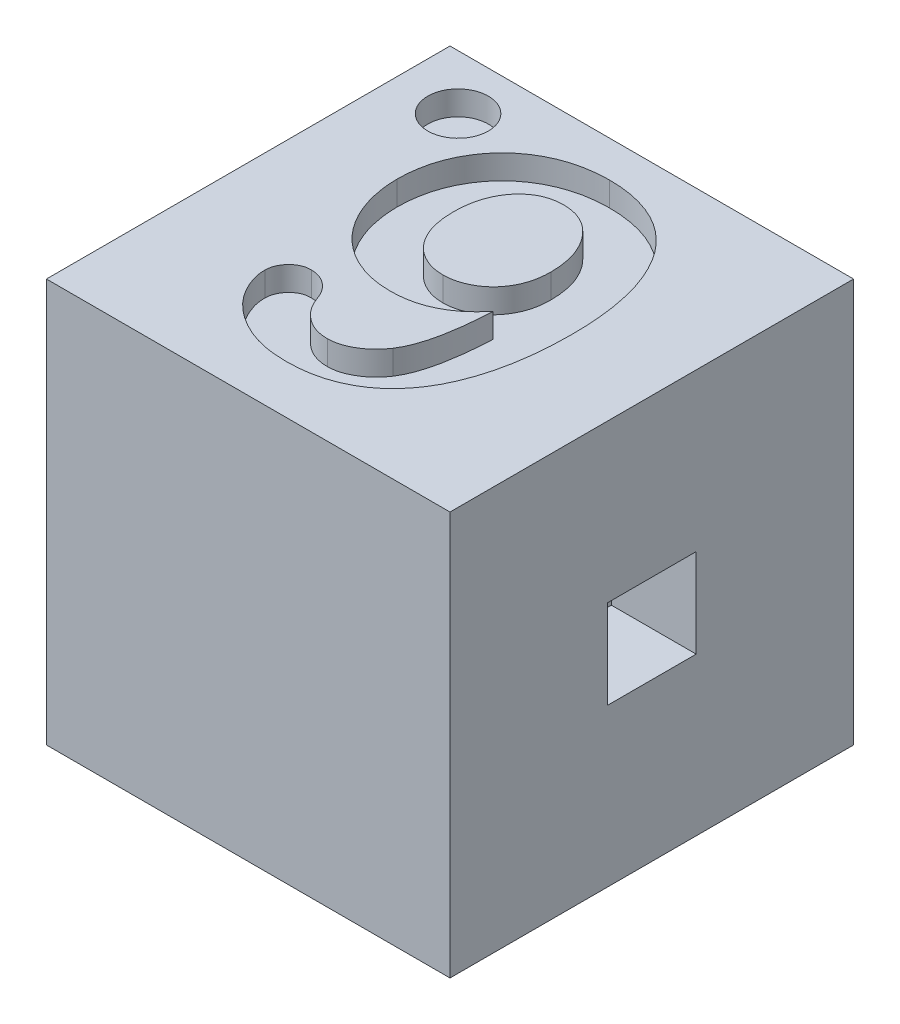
ISO-10303-21;
HEADER;
FILE_DESCRIPTION(('STEP AP214'),'2;1');
FILE_NAME('part.step','',(''),(''),'','','');
FILE_SCHEMA(('AUTOMOTIVE_DESIGN { 1 0 10303 214 1 1 1 1 }'));
ENDSEC;
DATA;
#1=APPLICATION_CONTEXT('core data for automotive mechanical design processes');
#2=APPLICATION_PROTOCOL_DEFINITION('international standard','automotive_design',2000,#1);
#3=PRODUCT_CONTEXT('',#1,'mechanical');
#4=PRODUCT('Part','Part','',(#3));
#5=PRODUCT_RELATED_PRODUCT_CATEGORY('part','',(#4));
#6=PRODUCT_DEFINITION_FORMATION('','',#4);
#7=PRODUCT_DEFINITION_CONTEXT('part definition',#1,'design');
#8=PRODUCT_DEFINITION('design','',#6,#7);
#9=PRODUCT_DEFINITION_SHAPE('','',#8);
#10=(LENGTH_UNIT() NAMED_UNIT(*) SI_UNIT(.MILLI.,.METRE.));
#11=(NAMED_UNIT(*) PLANE_ANGLE_UNIT() SI_UNIT($,.RADIAN.));
#12=(NAMED_UNIT(*) SI_UNIT($,.STERADIAN.) SOLID_ANGLE_UNIT());
#13=UNCERTAINTY_MEASURE_WITH_UNIT(LENGTH_MEASURE(1.E-05),#10,'distance_accuracy_value','');
#14=(GEOMETRIC_REPRESENTATION_CONTEXT(3) GLOBAL_UNCERTAINTY_ASSIGNED_CONTEXT((#13)) GLOBAL_UNIT_ASSIGNED_CONTEXT((#10,
#11,#12)) REPRESENTATION_CONTEXT('',''));
#15=CARTESIAN_POINT('',(0.,0.,0.));
#16=DIRECTION('',(0.,0.,1.));
#17=DIRECTION('',(1.,0.,0.));
#18=AXIS2_PLACEMENT_3D('',#15,#16,#17);
#19=CARTESIAN_POINT('',(-5.,5.,10.));
#20=DIRECTION('',(0.,-1.,0.));
#21=DIRECTION('',(0.,0.,-1.));
#22=AXIS2_PLACEMENT_3D('',#19,#20,#21);
#23=PLANE('',#22);
#24=CARTESIAN_POINT('',(-3.45,5.,1.35));
#25=DIRECTION('',(0.,1.,0.));
#26=DIRECTION('',(0.,0.,1.));
#27=AXIS2_PLACEMENT_3D('',#24,#25,#26);
#28=CIRCLE('',#27,0.75);
#29=CARTESIAN_POINT('',(-3.45,5.,2.1));
#30=VERTEX_POINT('',#29);
#31=EDGE_CURVE('E252',#30,#30,#28,.T.);
#32=ORIENTED_EDGE('',*,*,#31,.F.);
#33=EDGE_LOOP('',(#32));
#34=FACE_BOUND('',#33,.T.);
#35=DIRECTION('',(-1.,0.,0.));
#36=VECTOR('',#35,1.);
#37=CARTESIAN_POINT('',(-5.,5.,0.));
#38=LINE('',#37,#36);
#39=CARTESIAN_POINT('',(5.,5.,0.));
#40=VERTEX_POINT('',#39);
#41=CARTESIAN_POINT('',(-5.,5.,0.));
#42=VERTEX_POINT('',#41);
#43=EDGE_CURVE('E468',#40,#42,#38,.T.);
#44=ORIENTED_EDGE('',*,*,#43,.T.);
#45=DIRECTION('',(0.,0.,-1.));
#46=VECTOR('',#45,1.);
#47=CARTESIAN_POINT('',(-5.,5.,10.));
#48=LINE('',#47,#46);
#49=CARTESIAN_POINT('',(-5.,5.,10.));
#50=VERTEX_POINT('',#49);
#51=EDGE_CURVE('E474',#50,#42,#48,.T.);
#52=ORIENTED_EDGE('',*,*,#51,.F.);
#53=DIRECTION('',(-1.,0.,0.));
#54=VECTOR('',#53,1.);
#55=CARTESIAN_POINT('',(-5.,5.,10.));
#56=LINE('',#55,#54);
#57=CARTESIAN_POINT('',(5.,5.,10.));
#58=VERTEX_POINT('',#57);
#59=EDGE_CURVE('E472',#58,#50,#56,.T.);
#60=ORIENTED_EDGE('',*,*,#59,.F.);
#61=DIRECTION('',(0.,0.,-1.));
#62=VECTOR('',#61,1.);
#63=CARTESIAN_POINT('',(5.,5.,10.));
#64=LINE('',#63,#62);
#65=EDGE_CURVE('E484',#58,#40,#64,.T.);
#66=ORIENTED_EDGE('',*,*,#65,.T.);
#67=EDGE_LOOP('',(#44,#52,#60,#66));
#68=FACE_BOUND('',#67,.T.);
#69=CARTESIAN_POINT('',(0.778124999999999,5.00000000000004,7.19375));
#70=CARTESIAN_POINT('',(0.809534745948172,5.00000000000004,7.1423115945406));
#71=CARTESIAN_POINT('',(0.875980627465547,5.00000000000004,7.03349599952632));
#72=CARTESIAN_POINT('',(0.955770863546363,5.00000000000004,6.8472091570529));
#73=CARTESIAN_POINT('',(1.02438922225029,5.00000000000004,6.63376520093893));
#74=CARTESIAN_POINT('',(1.08843252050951,5.00000000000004,6.39382630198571));
#75=CARTESIAN_POINT('',(1.13543350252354,5.00000000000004,6.1247774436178));
#76=CARTESIAN_POINT('',(1.17874878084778,5.00000000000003,5.82902845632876));
#77=CARTESIAN_POINT('',(1.20905315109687,5.00000000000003,5.50511976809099));
#78=CARTESIAN_POINT('',(1.22159913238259,5.00000000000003,5.27973515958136));
#79=CARTESIAN_POINT('',(1.228125,5.00000000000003,5.1625));
#80=B_SPLINE_CURVE_WITH_KNOTS('',3,(#69,#70,#71,#72,#73,#74,#75,#76,#77,#78,#79),.UNSPECIFIED.,
.F.,.F.,(4,1,1,1,1,1,1,1,4),(0.,0.0859362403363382,0.181794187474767,0.28828383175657,
0.405842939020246,0.535897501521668,0.67782184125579,0.832417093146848,1.),.UNSPECIFIED.);
#81=CARTESIAN_POINT('',(0.778124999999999,5.,7.19375));
#82=VERTEX_POINT('',#81);
#83=CARTESIAN_POINT('',(1.228125,5.00000000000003,5.1625));
#84=VERTEX_POINT('',#83);
#85=EDGE_CURVE('E52',#82,#84,#80,.T.);
#86=ORIENTED_EDGE('',*,*,#85,.T.);
#87=CARTESIAN_POINT('',(1.228125,5.00000000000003,5.1625));
#88=CARTESIAN_POINT('',(1.16912559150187,5.00000000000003,5.23053500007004));
#89=CARTESIAN_POINT('',(1.05402120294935,5.00000000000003,5.36326729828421));
#90=CARTESIAN_POINT('',(0.861956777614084,5.00000000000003,5.53458821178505));
#91=CARTESIAN_POINT('',(0.664292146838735,5.00000000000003,5.68121653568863));
#92=CARTESIAN_POINT('',(0.455692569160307,5.00000000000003,5.79706552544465));
#93=CARTESIAN_POINT('',(0.238708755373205,5.00000000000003,5.88941758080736));
#94=CARTESIAN_POINT('',(0.00916204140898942,5.00000000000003,5.95311893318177));
#95=CARTESIAN_POINT('',(-0.232410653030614,5.00000000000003,5.9936277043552));
#96=CARTESIAN_POINT('',(-0.398271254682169,5.00000000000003,5.99784857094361));
#97=CARTESIAN_POINT('',(-0.482812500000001,5.00000000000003,6.));
#98=B_SPLINE_CURVE_WITH_KNOTS('',3,(#87,#88,#89,#90,#91,#92,#93,#94,#95,#96,#97),.UNSPECIFIED.,
.F.,.F.,(4,1,1,1,1,1,1,1,4),(0.,0.136777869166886,0.266845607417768,0.390376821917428,
0.510198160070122,0.628725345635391,0.748038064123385,0.871571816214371,1.),.UNSPECIFIED.);
#99=CARTESIAN_POINT('',(-0.482812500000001,5.00000000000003,6.));
#100=VERTEX_POINT('',#99);
#101=EDGE_CURVE('E294',#84,#100,#98,.T.);
#102=ORIENTED_EDGE('',*,*,#101,.T.);
#103=CARTESIAN_POINT('',(-0.482812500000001,5.00000000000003,6.));
#104=CARTESIAN_POINT('',(-0.564215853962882,5.00000000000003,5.99826530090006));
#105=CARTESIAN_POINT('',(-0.724726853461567,5.00000000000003,5.99484482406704));
#106=CARTESIAN_POINT('',(-0.960089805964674,5.00000000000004,5.95671769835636));
#107=CARTESIAN_POINT('',(-1.18666517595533,5.00000000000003,5.89982354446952));
#108=CARTESIAN_POINT('',(-1.40208767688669,5.00000000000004,5.81796689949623));
#109=CARTESIAN_POINT('',(-1.60640848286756,5.00000000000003,5.71614760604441));
#110=CARTESIAN_POINT('',(-1.79816046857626,5.00000000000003,5.59361189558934));
#111=CARTESIAN_POINT('',(-1.97652349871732,5.00000000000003,5.45041469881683));
#112=CARTESIAN_POINT('',(-2.14231913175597,5.00000000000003,5.29012694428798));
#113=CARTESIAN_POINT('',(-2.29151198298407,5.00000000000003,5.11090251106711));
#114=CARTESIAN_POINT('',(-2.42222507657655,5.00000000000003,4.91495982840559));
#115=CARTESIAN_POINT('',(-2.53744450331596,5.00000000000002,4.70472598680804));
#116=CARTESIAN_POINT('',(-2.63160606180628,5.00000000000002,4.48036147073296));
#117=CARTESIAN_POINT('',(-2.70708200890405,5.00000000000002,4.24623972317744));
#118=CARTESIAN_POINT('',(-2.75927290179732,5.00000000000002,4.00489472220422));
#119=CARTESIAN_POINT('',(-2.79391948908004,5.00000000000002,3.75881254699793));
#120=CARTESIAN_POINT('',(-2.79796573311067,5.00000000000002,3.59282564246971));
#121=CARTESIAN_POINT('',(-2.8,5.00000000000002,3.509375));
#122=B_SPLINE_CURVE_WITH_KNOTS('',3,(#103,#104,#105,#106,#107,#108,#109,#110,#111,#112,#113,
#114,#115,#116,#117,#118,#119,#120,#121),.UNSPECIFIED.,.F.,.F.,(4,1,1,1,1,1,1,1,1,1,1,1,1,1,1,1,
4),(0.,0.0642725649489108,0.126732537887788,0.187926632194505,0.248624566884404,
0.308446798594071,0.368046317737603,0.428083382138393,0.488916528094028,0.549994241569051,
0.61198048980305,0.674786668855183,0.739154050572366,0.803976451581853,0.868887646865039,
0.934082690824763,1.),.UNSPECIFIED.);
#123=CARTESIAN_POINT('',(-2.8,5.00000000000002,3.509375));
#124=VERTEX_POINT('',#123);
#125=EDGE_CURVE('E302',#100,#124,#122,.T.);
#126=ORIENTED_EDGE('',*,*,#125,.T.);
#127=CARTESIAN_POINT('',(-2.8,5.00000000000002,3.509375));
#128=CARTESIAN_POINT('',(-2.79938618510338,5.00000000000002,3.44891113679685));
#129=CARTESIAN_POINT('',(-2.79816653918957,5.00000000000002,3.32876986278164));
#130=CARTESIAN_POINT('',(-2.77964365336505,5.00000000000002,3.15094714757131));
#131=CARTESIAN_POINT('',(-2.75327199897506,5.00000000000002,2.97727465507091));
#132=CARTESIAN_POINT('',(-2.71802266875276,5.00000000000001,2.80719121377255));
#133=CARTESIAN_POINT('',(-2.66871792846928,5.00000000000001,2.64222476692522));
#134=CARTESIAN_POINT('',(-2.61138905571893,5.00000000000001,2.48057301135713));
#135=CARTESIAN_POINT('',(-2.54233667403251,5.00000000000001,2.32396182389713));
#136=CARTESIAN_POINT('',(-2.43650799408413,5.00000000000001,2.12322488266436));
#137=CARTESIAN_POINT('',(-2.2820269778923,5.00000000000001,1.88705368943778));
#138=CARTESIAN_POINT('',(-2.06070226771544,5.,1.63330490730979));
#139=CARTESIAN_POINT('',(-1.8036998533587,5.,1.41491380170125));
#140=CARTESIAN_POINT('',(-1.56685854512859,5.,1.25878780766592));
#141=CARTESIAN_POINT('',(-1.36183847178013,5.,1.15679422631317));
#142=CARTESIAN_POINT('',(-1.20341440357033,5.,1.08674226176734));
#143=CARTESIAN_POINT('',(-1.03882570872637,5.,1.02891175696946));
#144=CARTESIAN_POINT('',(-0.868823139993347,5.,0.982975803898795));
#145=CARTESIAN_POINT('',(-0.694334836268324,5.,0.944454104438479));
#146=CARTESIAN_POINT('',(-0.514702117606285,5.,0.918479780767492));
#147=CARTESIAN_POINT('',(-0.329991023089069,5.,0.902267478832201));
#148=CARTESIAN_POINT('',(-0.205242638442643,5.,0.900761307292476));
#149=CARTESIAN_POINT('',(-0.142187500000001,5.,0.900000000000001));
#150=B_SPLINE_CURVE_WITH_KNOTS('',3,(#127,#128,#129,#130,#131,#132,#133,#134,#135,#136,#137,
#138,#139,#140,#141,#142,#143,#144,#145,#146,#147,#148,#149),.UNSPECIFIED.,.F.,.F.,(4,1,1,1,1,1,
1,1,1,1,1,1,1,1,1,1,1,1,1,1,4),(0.,0.0434745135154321,0.0863835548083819,0.128455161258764,
0.169825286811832,0.211202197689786,0.252205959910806,0.293137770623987,0.334196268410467,
0.41535211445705,0.495533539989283,0.575507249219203,0.657290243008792,0.698843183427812,
0.740118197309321,0.781827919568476,0.824183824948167,0.866731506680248,0.910285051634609,
0.954652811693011,1.),.UNSPECIFIED.);
#151=CARTESIAN_POINT('',(-0.142187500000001,5.,0.900000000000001));
#152=VERTEX_POINT('',#151);
#153=EDGE_CURVE('E310',#124,#152,#150,.T.);
#154=ORIENTED_EDGE('',*,*,#153,.T.);
#155=CARTESIAN_POINT('',(-0.142187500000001,5.,0.900000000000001));
#156=CARTESIAN_POINT('',(-0.0697449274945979,5.,0.90105544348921));
#157=CARTESIAN_POINT('',(0.0728332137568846,5.,0.903132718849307));
#158=CARTESIAN_POINT('',(0.282781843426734,5.,0.923859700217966));
#159=CARTESIAN_POINT('',(0.484690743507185,5.,0.95844904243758));
#160=CARTESIAN_POINT('',(0.679700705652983,5.,1.00506084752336));
#161=CARTESIAN_POINT('',(0.866633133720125,5.,1.06593673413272));
#162=CARTESIAN_POINT('',(1.04643676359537,5.,1.13987621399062));
#163=CARTESIAN_POINT('',(1.2185538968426,5.,1.22731882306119));
#164=CARTESIAN_POINT('',(1.38249550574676,5.,1.32897078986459));
#165=CARTESIAN_POINT('',(1.53824745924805,5.00000000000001,1.44385517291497));
#166=CARTESIAN_POINT('',(1.68504763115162,5.,1.57143977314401));
#167=CARTESIAN_POINT('',(1.82121073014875,5.00000000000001,1.71368278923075));
#168=CARTESIAN_POINT('',(1.94981307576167,5.00000000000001,1.86626026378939));
#169=CARTESIAN_POINT('',(2.06755288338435,5.00000000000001,2.03322766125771));
#170=CARTESIAN_POINT('',(2.17463458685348,5.00000000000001,2.21366223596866));
#171=CARTESIAN_POINT('',(2.27539814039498,5.00000000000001,2.40543446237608));
#172=CARTESIAN_POINT('',(2.36380060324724,5.00000000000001,2.61116126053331));
#173=CARTESIAN_POINT('',(2.44388605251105,5.00000000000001,2.82842182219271));
#174=CARTESIAN_POINT('',(2.51227820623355,5.00000000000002,3.05815621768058));
#175=CARTESIAN_POINT('',(2.5693686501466,5.00000000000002,3.29936573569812));
#176=CARTESIAN_POINT('',(2.61893480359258,5.00000000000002,3.55137704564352));
#177=CARTESIAN_POINT('',(2.65358561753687,5.00000000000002,3.81609850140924));
#178=CARTESIAN_POINT('',(2.67983881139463,5.00000000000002,4.0923090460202));
#179=CARTESIAN_POINT('',(2.69830955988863,5.00000000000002,4.38048132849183));
#180=CARTESIAN_POINT('',(2.69942889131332,5.00000000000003,4.57653261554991));
#181=CARTESIAN_POINT('',(2.7,5.00000000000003,4.6765625));
#182=B_SPLINE_CURVE_WITH_KNOTS('',3,(#155,#156,#157,#158,#159,#160,#161,#162,#163,#164,#165,
#166,#167,#168,#169,#170,#171,#172,#173,#174,#175,#176,#177,#178,#179,#180,#181),.UNSPECIFIED.,
.F.,.F.,(4,1,1,1,1,1,1,1,1,1,1,1,1,1,1,1,1,1,1,1,1,1,1,1,4),(0.,0.0406210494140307,
0.0799484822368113,0.118175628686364,0.155443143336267,0.192301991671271,0.228322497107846,
0.264379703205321,0.300453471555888,0.33638503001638,0.372823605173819,0.409389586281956,
0.446716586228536,0.484647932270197,0.523824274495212,0.564327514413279,0.606060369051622,
0.649311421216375,0.694134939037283,0.740401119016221,0.788295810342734,0.838118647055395,
0.89006125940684,0.943906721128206,1.),.UNSPECIFIED.);
#183=CARTESIAN_POINT('',(2.7,5.00000000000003,4.6765625));
#184=VERTEX_POINT('',#183);
#185=EDGE_CURVE('E318',#152,#184,#182,.T.);
#186=ORIENTED_EDGE('',*,*,#185,.T.);
#187=CARTESIAN_POINT('',(2.7,5.00000000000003,4.6765625));
#188=CARTESIAN_POINT('',(2.69788974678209,5.00000000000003,4.83810845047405));
#189=CARTESIAN_POINT('',(2.69377838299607,5.00000000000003,5.15284516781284));
#190=CARTESIAN_POINT('',(2.65349101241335,5.00000000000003,5.61199494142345));
#191=CARTESIAN_POINT('',(2.59065866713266,5.00000000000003,6.04482098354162));
#192=CARTESIAN_POINT('',(2.50241983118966,5.00000000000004,6.45037550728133));
#193=CARTESIAN_POINT('',(2.38866517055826,5.00000000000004,6.82542921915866));
#194=CARTESIAN_POINT('',(2.25355564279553,5.00000000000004,7.16894940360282));
#195=CARTESIAN_POINT('',(2.09575201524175,5.00000000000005,7.47964291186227));
#196=CARTESIAN_POINT('',(1.91384875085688,5.00000000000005,7.75596067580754));
#197=CARTESIAN_POINT('',(1.71113552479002,5.00000000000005,8.00033711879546));
#198=CARTESIAN_POINT('',(1.48783173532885,5.00000000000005,8.21360696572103));
#199=CARTESIAN_POINT('',(1.2430545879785,5.00000000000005,8.39403306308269));
#200=CARTESIAN_POINT('',(0.977812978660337,5.00000000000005,8.54218781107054));
#201=CARTESIAN_POINT('',(0.693464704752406,5.00000000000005,8.65821749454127));
#202=CARTESIAN_POINT('',(0.389351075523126,5.00000000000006,8.74144349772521));
#203=CARTESIAN_POINT('',(0.0661303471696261,5.00000000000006,8.78975014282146));
#204=CARTESIAN_POINT('',(-0.155567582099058,5.00000000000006,8.79653576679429));
#205=CARTESIAN_POINT('',(-0.268750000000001,5.00000000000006,8.8));
#206=B_SPLINE_CURVE_WITH_KNOTS('',3,(#187,#188,#189,#190,#191,#192,#193,#194,#195,#196,#197,
#198,#199,#200,#201,#202,#203,#204,#205),.UNSPECIFIED.,.F.,.F.,(4,1,1,1,1,1,1,1,1,1,1,1,1,1,1,1,
4),(0.,0.0844220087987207,0.164477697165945,0.240709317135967,0.312906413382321,
0.381199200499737,0.445351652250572,0.50562034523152,0.563005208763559,0.61790429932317,
0.671244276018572,0.724005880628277,0.77641442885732,0.829648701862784,0.884135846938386,
0.940848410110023,1.),.UNSPECIFIED.);
#207=CARTESIAN_POINT('',(-0.268750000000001,5.00000000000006,8.8));
#208=VERTEX_POINT('',#207);
#209=EDGE_CURVE('E326',#184,#208,#206,.T.);
#210=ORIENTED_EDGE('',*,*,#209,.T.);
#211=CARTESIAN_POINT('',(-0.268750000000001,5.00000000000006,8.8));
#212=CARTESIAN_POINT('',(-0.3778105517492,5.00000000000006,8.79679700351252));
#213=CARTESIAN_POINT('',(-0.589844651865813,5.00000000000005,8.79056977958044));
#214=CARTESIAN_POINT('',(-0.898361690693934,5.00000000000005,8.73926210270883));
#215=CARTESIAN_POINT('',(-1.18688991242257,5.00000000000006,8.65585114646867));
#216=CARTESIAN_POINT('',(-1.45245098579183,5.00000000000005,8.53772956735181));
#217=CARTESIAN_POINT('',(-1.69203209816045,5.00000000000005,8.396365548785));
#218=CARTESIAN_POINT('',(-1.903183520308,5.00000000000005,8.2372095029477));
#219=CARTESIAN_POINT('',(-2.08206950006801,5.00000000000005,8.06030128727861));
#220=CARTESIAN_POINT('',(-2.22824945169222,5.00000000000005,7.87051582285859));
#221=CARTESIAN_POINT('',(-2.34231612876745,5.00000000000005,7.67516921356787));
#222=CARTESIAN_POINT('',(-2.42235108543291,5.00000000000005,7.48033883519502));
#223=CARTESIAN_POINT('',(-2.47711399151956,5.00000000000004,7.29048632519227));
#224=CARTESIAN_POINT('',(-2.48305106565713,5.00000000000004,7.1633651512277));
#225=CARTESIAN_POINT('',(-2.4859375,5.00000000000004,7.1015625));
#226=B_SPLINE_CURVE_WITH_KNOTS('',3,(#211,#212,#213,#214,#215,#216,#217,#218,#219,#220,#221,
#222,#223,#224,#225),.UNSPECIFIED.,.F.,.F.,(4,1,1,1,1,1,1,1,1,1,1,1,4),(0.,0.106388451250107,
0.206839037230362,0.30431693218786,0.398769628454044,0.489698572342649,0.57530386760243,
0.656179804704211,0.734469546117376,0.808492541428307,0.876179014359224,0.939801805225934,1.),.UNSPECIFIED.);
#227=CARTESIAN_POINT('',(-2.4859375,5.00000000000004,7.1015625));
#228=VERTEX_POINT('',#227);
#229=EDGE_CURVE('E334',#208,#228,#226,.T.);
#230=ORIENTED_EDGE('',*,*,#229,.T.);
#231=CARTESIAN_POINT('',(-2.4859375,5.00000000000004,7.1015625));
#232=CARTESIAN_POINT('',(-2.48365336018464,5.00000000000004,7.06542772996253));
#233=CARTESIAN_POINT('',(-2.47913890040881,5.00000000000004,6.9940096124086));
#234=CARTESIAN_POINT('',(-2.44804515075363,5.00000000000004,6.88904813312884));
#235=CARTESIAN_POINT('',(-2.39532756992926,5.00000000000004,6.79083619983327));
#236=CARTESIAN_POINT('',(-2.32597041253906,5.00000000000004,6.69868607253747));
#237=CARTESIAN_POINT('',(-2.23961654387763,5.00000000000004,6.62134660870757));
#238=CARTESIAN_POINT('',(-2.140065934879,5.00000000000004,6.56306386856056));
#239=CARTESIAN_POINT('',(-2.02842840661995,5.00000000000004,6.52727431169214));
#240=CARTESIAN_POINT('',(-1.94974552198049,5.00000000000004,6.52370588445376));
#241=CARTESIAN_POINT('',(-1.909375,5.00000000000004,6.521875));
#242=B_SPLINE_CURVE_WITH_KNOTS('',3,(#231,#232,#233,#234,#235,#236,#237,#238,#239,#240,#241),
.UNSPECIFIED.,.F.,.F.,(4,1,1,1,1,1,1,1,4),(0.,0.119605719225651,0.236393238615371,
0.359043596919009,0.487010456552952,0.616479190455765,0.740119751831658,0.866660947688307,1.),.UNSPECIFIED.);
#243=CARTESIAN_POINT('',(-1.909375,5.00000000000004,6.521875));
#244=VERTEX_POINT('',#243);
#245=EDGE_CURVE('E342',#228,#244,#242,.T.);
#246=ORIENTED_EDGE('',*,*,#245,.T.);
#247=CARTESIAN_POINT('',(-1.909375,5.00000000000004,6.521875));
#248=CARTESIAN_POINT('',(-1.87324499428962,5.00000000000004,6.52364926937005));
#249=CARTESIAN_POINT('',(-1.80092477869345,5.00000000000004,6.52720076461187));
#250=CARTESIAN_POINT('',(-1.69543778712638,5.00000000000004,6.55701666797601));
#251=CARTESIAN_POINT('',(-1.5935290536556,5.00000000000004,6.60298331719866));
#252=CARTESIAN_POINT('',(-1.49706673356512,5.00000000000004,6.66736296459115));
#253=CARTESIAN_POINT('',(-1.40810952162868,5.00000000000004,6.74774422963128));
#254=CARTESIAN_POINT('',(-1.3324757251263,5.00000000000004,6.84570287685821));
#255=CARTESIAN_POINT('',(-1.26766643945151,5.00000000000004,6.9561912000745));
#256=CARTESIAN_POINT('',(-1.23733513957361,5.00000000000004,7.0379925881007));
#257=CARTESIAN_POINT('',(-1.221875,5.00000000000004,7.0796875));
#258=B_SPLINE_CURVE_WITH_KNOTS('',3,(#247,#248,#249,#250,#251,#252,#253,#254,#255,#256,#257),
.UNSPECIFIED.,.F.,.F.,(4,1,1,1,1,1,1,1,4),(0.,0.114436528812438,0.229063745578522,
0.34515817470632,0.467971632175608,0.595453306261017,0.723703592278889,0.85916920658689,1.),.UNSPECIFIED.);
#259=CARTESIAN_POINT('',(-1.221875,5.00000000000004,7.0796875));
#260=VERTEX_POINT('',#259);
#261=EDGE_CURVE('E350',#244,#260,#258,.T.);
#262=ORIENTED_EDGE('',*,*,#261,.T.);
#263=CARTESIAN_POINT('',(-1.221875,5.00000000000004,7.0796875));
#264=CARTESIAN_POINT('',(-1.20052528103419,5.00000000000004,7.13203246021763));
#265=CARTESIAN_POINT('',(-1.15845353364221,5.00000000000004,7.23518341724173));
#266=CARTESIAN_POINT('',(-1.06925494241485,5.00000000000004,7.37422431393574));
#267=CARTESIAN_POINT('',(-0.965174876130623,5.00000000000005,7.4989006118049));
#268=CARTESIAN_POINT('',(-0.84271438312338,5.00000000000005,7.60423404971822));
#269=CARTESIAN_POINT('',(-0.707983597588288,5.00000000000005,7.6934602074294));
#270=CARTESIAN_POINT('',(-0.558434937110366,5.00000000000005,7.7536325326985));
#271=CARTESIAN_POINT('',(-0.399988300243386,5.00000000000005,7.79345840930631));
#272=CARTESIAN_POINT('',(-0.290354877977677,5.00000000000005,7.79778884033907));
#273=CARTESIAN_POINT('',(-0.234375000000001,5.00000000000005,7.8));
#274=B_SPLINE_CURVE_WITH_KNOTS('',3,(#263,#264,#265,#266,#267,#268,#269,#270,#271,#272,#273),
.UNSPECIFIED.,.F.,.F.,(4,1,1,1,1,1,1,1,4),(0.,0.129820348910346,0.255823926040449,
0.378261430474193,0.502260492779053,0.626242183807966,0.748192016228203,0.871424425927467,1.),.UNSPECIFIED.);
#275=CARTESIAN_POINT('',(-0.234375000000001,5.00000000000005,7.8));
#276=VERTEX_POINT('',#275);
#277=EDGE_CURVE('E358',#260,#276,#274,.T.);
#278=ORIENTED_EDGE('',*,*,#277,.T.);
#279=CARTESIAN_POINT('',(-0.234375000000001,5.00000000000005,7.8));
#280=CARTESIAN_POINT('',(-0.188418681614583,5.00000000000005,7.79753148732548));
#281=CARTESIAN_POINT('',(-0.0950861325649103,5.00000000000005,7.79251819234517));
#282=CARTESIAN_POINT('',(0.044374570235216,5.00000000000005,7.76277459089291));
#283=CARTESIAN_POINT('',(0.182294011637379,5.00000000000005,7.70901516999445));
#284=CARTESIAN_POINT('',(0.318351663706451,5.00000000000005,7.63746907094));
#285=CARTESIAN_POINT('',(0.450086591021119,5.00000000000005,7.54981786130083));
#286=CARTESIAN_POINT('',(0.57158040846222,5.00000000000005,7.44479218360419));
#287=CARTESIAN_POINT('',(0.682913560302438,5.00000000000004,7.32691871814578));
#288=CARTESIAN_POINT('',(0.746287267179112,5.00000000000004,7.23828025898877));
#289=CARTESIAN_POINT('',(0.778124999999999,5.00000000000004,7.19375));
#290=B_SPLINE_CURVE_WITH_KNOTS('',3,(#279,#280,#281,#282,#283,#284,#285,#286,#287,#288,#289),
.UNSPECIFIED.,.F.,.F.,(4,1,1,1,1,1,1,1,4),(0.,0.112543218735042,0.228563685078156,
0.347188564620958,0.47378032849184,0.604254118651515,0.733545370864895,0.866138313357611,1.),.UNSPECIFIED.);
#291=EDGE_CURVE('E366',#276,#82,#290,.T.);
#292=ORIENTED_EDGE('',*,*,#291,.T.);
#293=EDGE_LOOP('',(#86,#102,#126,#154,#186,#210,#230,#246,#262,#278,#292));
#294=FACE_BOUND('',#293,.T.);
#295=ADVANCED_FACE('F37',(#34,#68,#294),#23,.F.);
#296=CARTESIAN_POINT('',(5.,5.,10.));
#297=DIRECTION('',(-1.,0.,0.));
#298=DIRECTION('',(0.,-1.,0.));
#299=AXIS2_PLACEMENT_3D('',#296,#297,#298);
#300=PLANE('',#299);
#301=DIRECTION('',(0.,1.,0.));
#302=VECTOR('',#301,1.);
#303=CARTESIAN_POINT('',(5.,5.,0.));
#304=LINE('',#303,#302);
#305=CARTESIAN_POINT('',(5.,-5.,0.));
#306=VERTEX_POINT('',#305);
#307=EDGE_CURVE('E479',#306,#40,#304,.T.);
#308=ORIENTED_EDGE('',*,*,#307,.T.);
#309=ORIENTED_EDGE('',*,*,#65,.F.);
#310=DIRECTION('',(0.,1.,0.));
#311=VECTOR('',#310,1.);
#312=CARTESIAN_POINT('',(5.,5.,10.));
#313=LINE('',#312,#311);
#314=CARTESIAN_POINT('',(5.,-5.,10.));
#315=VERTEX_POINT('',#314);
#316=EDGE_CURVE('E470',#315,#58,#313,.T.);
#317=ORIENTED_EDGE('',*,*,#316,.F.);
#318=DIRECTION('',(0.,0.,-1.));
#319=VECTOR('',#318,1.);
#320=CARTESIAN_POINT('',(5.,-5.,10.));
#321=LINE('',#320,#319);
#322=EDGE_CURVE('E45',#315,#306,#321,.T.);
#323=ORIENTED_EDGE('',*,*,#322,.T.);
#324=EDGE_LOOP('',(#308,#309,#317,#323));
#325=FACE_BOUND('',#324,.T.);
#326=DIRECTION('',(0.,0.,1.));
#327=VECTOR('',#326,1.);
#328=CARTESIAN_POINT('',(5.,-1.1,3.9));
#329=LINE('',#328,#327);
#330=CARTESIAN_POINT('',(5.,-1.1,3.9));
#331=VERTEX_POINT('',#330);
#332=CARTESIAN_POINT('',(5.,-1.1,6.1));
#333=VERTEX_POINT('',#332);
#334=EDGE_CURVE('E399',#331,#333,#329,.T.);
#335=ORIENTED_EDGE('',*,*,#334,.T.);
#336=DIRECTION('',(0.,1.,0.));
#337=VECTOR('',#336,1.);
#338=CARTESIAN_POINT('',(5.,-1.1,6.1));
#339=LINE('',#338,#337);
#340=CARTESIAN_POINT('',(5.,1.1,6.1));
#341=VERTEX_POINT('',#340);
#342=EDGE_CURVE('E413',#333,#341,#339,.T.);
#343=ORIENTED_EDGE('',*,*,#342,.T.);
#344=DIRECTION('',(0.,0.,-1.));
#345=VECTOR('',#344,1.);
#346=CARTESIAN_POINT('',(5.,1.1,6.1));
#347=LINE('',#346,#345);
#348=CARTESIAN_POINT('',(5.,1.1,3.9));
#349=VERTEX_POINT('',#348);
#350=EDGE_CURVE('E416',#341,#349,#347,.T.);
#351=ORIENTED_EDGE('',*,*,#350,.T.);
#352=DIRECTION('',(0.,-1.,0.));
#353=VECTOR('',#352,1.);
#354=CARTESIAN_POINT('',(5.,1.1,3.9));
#355=LINE('',#354,#353);
#356=EDGE_CURVE('E404',#349,#331,#355,.T.);
#357=ORIENTED_EDGE('',*,*,#356,.T.);
#358=EDGE_LOOP('',(#335,#343,#351,#357));
#359=FACE_BOUND('',#358,.T.);
#360=ADVANCED_FACE('F491',(#325,#359),#300,.F.);
#361=CARTESIAN_POINT('',(-5.,5.,10.));
#362=DIRECTION('',(1.,0.,0.));
#363=DIRECTION('',(0.,0.,-1.));
#364=AXIS2_PLACEMENT_3D('',#361,#362,#363);
#365=PLANE('',#364);
#366=DIRECTION('',(0.,-1.,0.));
#367=VECTOR('',#366,1.);
#368=CARTESIAN_POINT('',(-5.,-1.,6.));
#369=LINE('',#368,#367);
#370=CARTESIAN_POINT('',(-5.,1.,6.));
#371=VERTEX_POINT('',#370);
#372=CARTESIAN_POINT('',(-5.,-1.,6.));
#373=VERTEX_POINT('',#372);
#374=EDGE_CURVE('E435',#371,#373,#369,.T.);
#375=ORIENTED_EDGE('',*,*,#374,.T.);
#376=DIRECTION('',(0.,0.,-1.));
#377=VECTOR('',#376,1.);
#378=CARTESIAN_POINT('',(-5.,-1.,6.));
#379=LINE('',#378,#377);
#380=CARTESIAN_POINT('',(-5.,-1.,4.));
#381=VERTEX_POINT('',#380);
#382=EDGE_CURVE('E430',#373,#381,#379,.T.);
#383=ORIENTED_EDGE('',*,*,#382,.T.);
#384=DIRECTION('',(0.,1.,0.));
#385=VECTOR('',#384,1.);
#386=CARTESIAN_POINT('',(-5.,-1.,4.));
#387=LINE('',#386,#385);
#388=CARTESIAN_POINT('',(-5.,1.,4.));
#389=VERTEX_POINT('',#388);
#390=EDGE_CURVE('E447',#381,#389,#387,.T.);
#391=ORIENTED_EDGE('',*,*,#390,.T.);
#392=DIRECTION('',(0.,0.,1.));
#393=VECTOR('',#392,1.);
#394=CARTESIAN_POINT('',(-5.,1.,6.));
#395=LINE('',#394,#393);
#396=EDGE_CURVE('E450',#389,#371,#395,.T.);
#397=ORIENTED_EDGE('',*,*,#396,.T.);
#398=EDGE_LOOP('',(#375,#383,#391,#397));
#399=FACE_BOUND('',#398,.T.);
#400=DIRECTION('',(0.,-1.,0.));
#401=VECTOR('',#400,1.);
#402=CARTESIAN_POINT('',(-5.,5.,0.));
#403=LINE('',#402,#401);
#404=CARTESIAN_POINT('',(-5.,-5.,0.));
#405=VERTEX_POINT('',#404);
#406=EDGE_CURVE('E458',#42,#405,#403,.T.);
#407=ORIENTED_EDGE('',*,*,#406,.T.);
#408=DIRECTION('',(0.,0.,-1.));
#409=VECTOR('',#408,1.);
#410=CARTESIAN_POINT('',(-5.,-5.,10.));
#411=LINE('',#410,#409);
#412=CARTESIAN_POINT('',(-5.,-5.,10.));
#413=VERTEX_POINT('',#412);
#414=EDGE_CURVE('E11',#413,#405,#411,.T.);
#415=ORIENTED_EDGE('',*,*,#414,.F.);
#416=DIRECTION('',(0.,-1.,0.));
#417=VECTOR('',#416,1.);
#418=CARTESIAN_POINT('',(-5.,5.,10.));
#419=LINE('',#418,#417);
#420=EDGE_CURVE('E464',#50,#413,#419,.T.);
#421=ORIENTED_EDGE('',*,*,#420,.F.);
#422=ORIENTED_EDGE('',*,*,#51,.T.);
#423=EDGE_LOOP('',(#407,#415,#421,#422));
#424=FACE_BOUND('',#423,.T.);
#425=ADVANCED_FACE('F39',(#399,#424),#365,.F.);
#426=CARTESIAN_POINT('',(-5.,-5.,10.));
#427=DIRECTION('',(0.,1.,0.));
#428=DIRECTION('',(0.,0.,1.));
#429=AXIS2_PLACEMENT_3D('',#426,#427,#428);
#430=PLANE('',#429);
#431=DIRECTION('',(1.,0.,0.));
#432=VECTOR('',#431,1.);
#433=CARTESIAN_POINT('',(-5.,-5.,0.));
#434=LINE('',#433,#432);
#435=EDGE_CURVE('E477',#405,#306,#434,.T.);
#436=ORIENTED_EDGE('',*,*,#435,.T.);
#437=ORIENTED_EDGE('',*,*,#322,.F.);
#438=DIRECTION('',(1.,0.,0.));
#439=VECTOR('',#438,1.);
#440=CARTESIAN_POINT('',(-5.,-5.,10.));
#441=LINE('',#440,#439);
#442=EDGE_CURVE('E467',#413,#315,#441,.T.);
#443=ORIENTED_EDGE('',*,*,#442,.F.);
#444=ORIENTED_EDGE('',*,*,#414,.T.);
#445=EDGE_LOOP('',(#436,#437,#443,#444));
#446=FACE_BOUND('',#445,.T.);
#447=ADVANCED_FACE('F508',(#446),#430,.F.);
#448=CARTESIAN_POINT('',(0.,0.,10.));
#449=DIRECTION('',(0.,0.,1.));
#450=DIRECTION('',(1.,0.,0.));
#451=AXIS2_PLACEMENT_3D('',#448,#449,#450);
#452=PLANE('',#451);
#453=ORIENTED_EDGE('',*,*,#420,.T.);
#454=ORIENTED_EDGE('',*,*,#442,.T.);
#455=ORIENTED_EDGE('',*,*,#316,.T.);
#456=ORIENTED_EDGE('',*,*,#59,.T.);
#457=EDGE_LOOP('',(#453,#454,#455,#456));
#458=FACE_BOUND('',#457,.T.);
#459=ADVANCED_FACE('F507',(#458),#452,.T.);
#460=CARTESIAN_POINT('',(0.,0.,0.));
#461=DIRECTION('',(0.,0.,1.));
#462=DIRECTION('',(1.,0.,0.));
#463=AXIS2_PLACEMENT_3D('',#460,#461,#462);
#464=PLANE('',#463);
#465=ORIENTED_EDGE('',*,*,#406,.F.);
#466=ORIENTED_EDGE('',*,*,#43,.F.);
#467=ORIENTED_EDGE('',*,*,#307,.F.);
#468=ORIENTED_EDGE('',*,*,#435,.F.);
#469=EDGE_LOOP('',(#465,#466,#467,#468));
#470=FACE_BOUND('',#469,.T.);
#471=ADVANCED_FACE('F498',(#470),#464,.F.);
#472=CARTESIAN_POINT('',(-7.,-1.,6.));
#473=DIRECTION('',(0.,-1.,0.));
#474=DIRECTION('',(0.,0.,-1.));
#475=AXIS2_PLACEMENT_3D('',#472,#473,#474);
#476=PLANE('',#475);
#477=ORIENTED_EDGE('',*,*,#382,.F.);
#478=DIRECTION('',(1.,0.,0.));
#479=VECTOR('',#478,1.);
#480=CARTESIAN_POINT('',(-7.,-1.,6.));
#481=LINE('',#480,#479);
#482=CARTESIAN_POINT('',(-7.,-1.,6.));
#483=VERTEX_POINT('',#482);
#484=EDGE_CURVE('E455',#483,#373,#481,.T.);
#485=ORIENTED_EDGE('',*,*,#484,.F.);
#486=DIRECTION('',(0.,0.,-1.));
#487=VECTOR('',#486,1.);
#488=CARTESIAN_POINT('',(-7.,-1.,6.));
#489=LINE('',#488,#487);
#490=CARTESIAN_POINT('',(-7.,-1.,4.));
#491=VERTEX_POINT('',#490);
#492=EDGE_CURVE('E431',#483,#491,#489,.T.);
#493=ORIENTED_EDGE('',*,*,#492,.T.);
#494=DIRECTION('',(1.,0.,0.));
#495=VECTOR('',#494,1.);
#496=CARTESIAN_POINT('',(-7.,-1.,4.));
#497=LINE('',#496,#495);
#498=EDGE_CURVE('E444',#491,#381,#497,.T.);
#499=ORIENTED_EDGE('',*,*,#498,.T.);
#500=EDGE_LOOP('',(#477,#485,#493,#499));
#501=FACE_BOUND('',#500,.T.);
#502=ADVANCED_FACE('F622',(#501),#476,.T.);
#503=CARTESIAN_POINT('',(-7.,-1.,6.));
#504=DIRECTION('',(0.,0.,1.));
#505=DIRECTION('',(1.,0.,0.));
#506=AXIS2_PLACEMENT_3D('',#503,#504,#505);
#507=PLANE('',#506);
#508=ORIENTED_EDGE('',*,*,#374,.F.);
#509=DIRECTION('',(1.,0.,0.));
#510=VECTOR('',#509,1.);
#511=CARTESIAN_POINT('',(-7.,1.,6.));
#512=LINE('',#511,#510);
#513=CARTESIAN_POINT('',(-7.,1.,6.));
#514=VERTEX_POINT('',#513);
#515=EDGE_CURVE('E459',#514,#371,#512,.T.);
#516=ORIENTED_EDGE('',*,*,#515,.F.);
#517=DIRECTION('',(0.,-1.,0.));
#518=VECTOR('',#517,1.);
#519=CARTESIAN_POINT('',(-7.,-1.,6.));
#520=LINE('',#519,#518);
#521=EDGE_CURVE('E441',#514,#483,#520,.T.);
#522=ORIENTED_EDGE('',*,*,#521,.T.);
#523=ORIENTED_EDGE('',*,*,#484,.T.);
#524=EDGE_LOOP('',(#508,#516,#522,#523));
#525=FACE_BOUND('',#524,.T.);
#526=ADVANCED_FACE('F618',(#525),#507,.T.);
#527=CARTESIAN_POINT('',(-7.,1.,6.));
#528=DIRECTION('',(0.,1.,0.));
#529=DIRECTION('',(0.,0.,1.));
#530=AXIS2_PLACEMENT_3D('',#527,#528,#529);
#531=PLANE('',#530);
#532=ORIENTED_EDGE('',*,*,#396,.F.);
#533=DIRECTION('',(1.,0.,0.));
#534=VECTOR('',#533,1.);
#535=CARTESIAN_POINT('',(-7.,1.,4.));
#536=LINE('',#535,#534);
#537=CARTESIAN_POINT('',(-7.,1.,4.));
#538=VERTEX_POINT('',#537);
#539=EDGE_CURVE('E461',#538,#389,#536,.T.);
#540=ORIENTED_EDGE('',*,*,#539,.F.);
#541=DIRECTION('',(0.,0.,1.));
#542=VECTOR('',#541,1.);
#543=CARTESIAN_POINT('',(-7.,1.,6.));
#544=LINE('',#543,#542);
#545=EDGE_CURVE('E438',#538,#514,#544,.T.);
#546=ORIENTED_EDGE('',*,*,#545,.T.);
#547=ORIENTED_EDGE('',*,*,#515,.T.);
#548=EDGE_LOOP('',(#532,#540,#546,#547));
#549=FACE_BOUND('',#548,.T.);
#550=ADVANCED_FACE('F621',(#549),#531,.T.);
#551=CARTESIAN_POINT('',(-7.,-1.,4.));
#552=DIRECTION('',(0.,0.,-1.));
#553=DIRECTION('',(-1.,0.,0.));
#554=AXIS2_PLACEMENT_3D('',#551,#552,#553);
#555=PLANE('',#554);
#556=ORIENTED_EDGE('',*,*,#390,.F.);
#557=ORIENTED_EDGE('',*,*,#498,.F.);
#558=DIRECTION('',(0.,1.,0.));
#559=VECTOR('',#558,1.);
#560=CARTESIAN_POINT('',(-7.,-1.,4.));
#561=LINE('',#560,#559);
#562=EDGE_CURVE('E434',#491,#538,#561,.T.);
#563=ORIENTED_EDGE('',*,*,#562,.T.);
#564=ORIENTED_EDGE('',*,*,#539,.T.);
#565=EDGE_LOOP('',(#556,#557,#563,#564));
#566=FACE_BOUND('',#565,.T.);
#567=ADVANCED_FACE('F616',(#566),#555,.T.);
#568=CARTESIAN_POINT('',(-7.,0.,0.));
#569=DIRECTION('',(1.,0.,0.));
#570=DIRECTION('',(0.,0.,-1.));
#571=AXIS2_PLACEMENT_3D('',#568,#569,#570);
#572=PLANE('',#571);
#573=ORIENTED_EDGE('',*,*,#492,.F.);
#574=ORIENTED_EDGE('',*,*,#521,.F.);
#575=ORIENTED_EDGE('',*,*,#545,.F.);
#576=ORIENTED_EDGE('',*,*,#562,.F.);
#577=EDGE_LOOP('',(#573,#574,#575,#576));
#578=FACE_BOUND('',#577,.T.);
#579=ADVANCED_FACE('F612',(#578),#572,.F.);
#580=CARTESIAN_POINT('',(2.9,-1.1,3.9));
#581=DIRECTION('',(0.,1.,0.));
#582=DIRECTION('',(0.,0.,1.));
#583=AXIS2_PLACEMENT_3D('',#580,#581,#582);
#584=PLANE('',#583);
#585=ORIENTED_EDGE('',*,*,#334,.F.);
#586=DIRECTION('',(1.,0.,0.));
#587=VECTOR('',#586,1.);
#588=CARTESIAN_POINT('',(2.9,-1.1,3.9));
#589=LINE('',#588,#587);
#590=CARTESIAN_POINT('',(2.9,-1.1,3.9));
#591=VERTEX_POINT('',#590);
#592=EDGE_CURVE('E410',#591,#331,#589,.T.);
#593=ORIENTED_EDGE('',*,*,#592,.F.);
#594=DIRECTION('',(0.,0.,1.));
#595=VECTOR('',#594,1.);
#596=CARTESIAN_POINT('',(2.9,-1.1,3.9));
#597=LINE('',#596,#595);
#598=CARTESIAN_POINT('',(2.9,-1.1,6.1));
#599=VERTEX_POINT('',#598);
#600=EDGE_CURVE('E400',#591,#599,#597,.T.);
#601=ORIENTED_EDGE('',*,*,#600,.T.);
#602=DIRECTION('',(1.,0.,0.));
#603=VECTOR('',#602,1.);
#604=CARTESIAN_POINT('',(2.9,-1.1,6.1));
#605=LINE('',#604,#603);
#606=EDGE_CURVE('E427',#599,#333,#605,.T.);
#607=ORIENTED_EDGE('',*,*,#606,.T.);
#608=EDGE_LOOP('',(#585,#593,#601,#607));
#609=FACE_BOUND('',#608,.T.);
#610=ADVANCED_FACE('F608',(#609),#584,.T.);
#611=CARTESIAN_POINT('',(2.9,-1.1,6.1));
#612=DIRECTION('',(0.,0.,-1.));
#613=DIRECTION('',(-1.,0.,0.));
#614=AXIS2_PLACEMENT_3D('',#611,#612,#613);
#615=PLANE('',#614);
#616=ORIENTED_EDGE('',*,*,#342,.F.);
#617=ORIENTED_EDGE('',*,*,#606,.F.);
#618=DIRECTION('',(0.,1.,0.));
#619=VECTOR('',#618,1.);
#620=CARTESIAN_POINT('',(2.9,-1.1,6.1));
#621=LINE('',#620,#619);
#622=CARTESIAN_POINT('',(2.9,1.1,6.1));
#623=VERTEX_POINT('',#622);
#624=EDGE_CURVE('E403',#599,#623,#621,.T.);
#625=ORIENTED_EDGE('',*,*,#624,.T.);
#626=DIRECTION('',(1.,0.,0.));
#627=VECTOR('',#626,1.);
#628=CARTESIAN_POINT('',(2.9,1.1,6.1));
#629=LINE('',#628,#627);
#630=EDGE_CURVE('E425',#623,#341,#629,.T.);
#631=ORIENTED_EDGE('',*,*,#630,.T.);
#632=EDGE_LOOP('',(#616,#617,#625,#631));
#633=FACE_BOUND('',#632,.T.);
#634=ADVANCED_FACE('F604',(#633),#615,.T.);
#635=CARTESIAN_POINT('',(2.9,1.1,6.1));
#636=DIRECTION('',(0.,-1.,0.));
#637=DIRECTION('',(0.,0.,-1.));
#638=AXIS2_PLACEMENT_3D('',#635,#636,#637);
#639=PLANE('',#638);
#640=ORIENTED_EDGE('',*,*,#350,.F.);
#641=ORIENTED_EDGE('',*,*,#630,.F.);
#642=DIRECTION('',(0.,0.,-1.));
#643=VECTOR('',#642,1.);
#644=CARTESIAN_POINT('',(2.9,1.1,6.1));
#645=LINE('',#644,#643);
#646=CARTESIAN_POINT('',(2.9,1.1,3.9));
#647=VERTEX_POINT('',#646);
#648=EDGE_CURVE('E406',#623,#647,#645,.T.);
#649=ORIENTED_EDGE('',*,*,#648,.T.);
#650=DIRECTION('',(1.,0.,0.));
#651=VECTOR('',#650,1.);
#652=CARTESIAN_POINT('',(2.9,1.1,3.9));
#653=LINE('',#652,#651);
#654=EDGE_CURVE('E423',#647,#349,#653,.T.);
#655=ORIENTED_EDGE('',*,*,#654,.T.);
#656=EDGE_LOOP('',(#640,#641,#649,#655));
#657=FACE_BOUND('',#656,.T.);
#658=ADVANCED_FACE('F600',(#657),#639,.T.);
#659=CARTESIAN_POINT('',(2.9,1.1,3.9));
#660=DIRECTION('',(0.,0.,1.));
#661=DIRECTION('',(1.,0.,0.));
#662=AXIS2_PLACEMENT_3D('',#659,#660,#661);
#663=PLANE('',#662);
#664=ORIENTED_EDGE('',*,*,#356,.F.);
#665=ORIENTED_EDGE('',*,*,#654,.F.);
#666=DIRECTION('',(0.,-1.,0.));
#667=VECTOR('',#666,1.);
#668=CARTESIAN_POINT('',(2.9,1.1,3.9));
#669=LINE('',#668,#667);
#670=EDGE_CURVE('E408',#647,#591,#669,.T.);
#671=ORIENTED_EDGE('',*,*,#670,.T.);
#672=ORIENTED_EDGE('',*,*,#592,.T.);
#673=EDGE_LOOP('',(#664,#665,#671,#672));
#674=FACE_BOUND('',#673,.T.);
#675=ADVANCED_FACE('F596',(#674),#663,.T.);
#676=CARTESIAN_POINT('',(2.9,0.,0.));
#677=DIRECTION('',(-1.,0.,0.));
#678=DIRECTION('',(0.,0.,1.));
#679=AXIS2_PLACEMENT_3D('',#676,#677,#678);
#680=PLANE('',#679);
#681=ORIENTED_EDGE('',*,*,#600,.F.);
#682=ORIENTED_EDGE('',*,*,#670,.F.);
#683=ORIENTED_EDGE('',*,*,#648,.F.);
#684=ORIENTED_EDGE('',*,*,#624,.F.);
#685=EDGE_LOOP('',(#681,#682,#683,#684));
#686=FACE_BOUND('',#685,.T.);
#687=ADVANCED_FACE('F592',(#686),#680,.F.);
#688=CARTESIAN_POINT('',(0.778124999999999,4.40000000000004,7.19375));
#689=CARTESIAN_POINT('',(0.809534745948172,4.40000000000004,7.1423115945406));
#690=CARTESIAN_POINT('',(0.875980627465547,4.40000000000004,7.03349599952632));
#691=CARTESIAN_POINT('',(0.955770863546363,4.40000000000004,6.8472091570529));
#692=CARTESIAN_POINT('',(1.02438922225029,4.40000000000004,6.63376520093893));
#693=CARTESIAN_POINT('',(1.08843252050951,4.40000000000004,6.39382630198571));
#694=CARTESIAN_POINT('',(1.13543350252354,4.40000000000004,6.1247774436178));
#695=CARTESIAN_POINT('',(1.17874878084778,4.40000000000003,5.82902845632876));
#696=CARTESIAN_POINT('',(1.20905315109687,4.40000000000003,5.50511976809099));
#697=CARTESIAN_POINT('',(1.22159913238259,4.40000000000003,5.27973515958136));
#698=CARTESIAN_POINT('',(1.228125,4.40000000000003,5.1625));
#699=B_SPLINE_CURVE_WITH_KNOTS('',3,(#688,#689,#690,#691,#692,#693,#694,#695,#696,#697,#698),
.UNSPECIFIED.,.F.,.F.,(4,1,1,1,1,1,1,1,4),(0.,0.0859362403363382,0.181794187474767,
0.28828383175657,0.405842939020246,0.535897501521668,0.67782184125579,0.832417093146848,1.),.UNSPECIFIED.);
#700=DIRECTION('',(0.,1.,0.));
#701=VECTOR('',#700,1.);
#702=SURFACE_OF_LINEAR_EXTRUSION('',#699,#701);
#703=ORIENTED_EDGE('',*,*,#85,.F.);
#704=DIRECTION('',(0.,1.,0.));
#705=VECTOR('',#704,1.);
#706=CARTESIAN_POINT('',(0.778124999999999,4.40000000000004,7.19375));
#707=LINE('',#706,#705);
#708=CARTESIAN_POINT('',(0.778124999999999,4.40000000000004,7.19375));
#709=VERTEX_POINT('',#708);
#710=EDGE_CURVE('E282',#709,#82,#707,.T.);
#711=ORIENTED_EDGE('',*,*,#710,.F.);
#712=CARTESIAN_POINT('',(1.228125,4.40000000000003,5.1625));
#713=VERTEX_POINT('',#712);
#714=EDGE_CURVE('E374',#709,#713,#699,.T.);
#715=ORIENTED_EDGE('',*,*,#714,.T.);
#716=DIRECTION('',(0.,1.,0.));
#717=VECTOR('',#716,1.);
#718=CARTESIAN_POINT('',(1.228125,4.40000000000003,5.1625));
#719=LINE('',#718,#717);
#720=EDGE_CURVE('E397',#713,#84,#719,.T.);
#721=ORIENTED_EDGE('',*,*,#720,.T.);
#722=EDGE_LOOP('',(#703,#711,#715,#721));
#723=FACE_BOUND('',#722,.T.);
#724=ADVANCED_FACE('F587',(#723),#702,.T.);
#725=CARTESIAN_POINT('',(1.228125,4.40000000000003,5.1625));
#726=CARTESIAN_POINT('',(1.16912559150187,4.40000000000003,5.23053500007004));
#727=CARTESIAN_POINT('',(1.05402120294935,4.40000000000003,5.36326729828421));
#728=CARTESIAN_POINT('',(0.861956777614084,4.40000000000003,5.53458821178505));
#729=CARTESIAN_POINT('',(0.664292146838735,4.40000000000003,5.68121653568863));
#730=CARTESIAN_POINT('',(0.455692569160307,4.40000000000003,5.79706552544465));
#731=CARTESIAN_POINT('',(0.238708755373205,4.40000000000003,5.88941758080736));
#732=CARTESIAN_POINT('',(0.00916204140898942,4.40000000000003,5.95311893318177));
#733=CARTESIAN_POINT('',(-0.232410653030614,4.40000000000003,5.9936277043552));
#734=CARTESIAN_POINT('',(-0.398271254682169,4.40000000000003,5.99784857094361));
#735=CARTESIAN_POINT('',(-0.482812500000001,4.40000000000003,6.));
#736=B_SPLINE_CURVE_WITH_KNOTS('',3,(#725,#726,#727,#728,#729,#730,#731,#732,#733,#734,#735),
.UNSPECIFIED.,.F.,.F.,(4,1,1,1,1,1,1,1,4),(0.,0.136777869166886,0.266845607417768,
0.390376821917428,0.510198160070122,0.628725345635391,0.748038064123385,0.871571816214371,1.),.UNSPECIFIED.);
#737=DIRECTION('',(0.,1.,0.));
#738=VECTOR('',#737,1.);
#739=SURFACE_OF_LINEAR_EXTRUSION('',#736,#738);
#740=ORIENTED_EDGE('',*,*,#101,.F.);
#741=ORIENTED_EDGE('',*,*,#720,.F.);
#742=CARTESIAN_POINT('',(-0.482812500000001,4.40000000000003,6.));
#743=VERTEX_POINT('',#742);
#744=EDGE_CURVE('E578',#713,#743,#736,.T.);
#745=ORIENTED_EDGE('',*,*,#744,.T.);
#746=DIRECTION('',(0.,1.,0.));
#747=VECTOR('',#746,1.);
#748=CARTESIAN_POINT('',(-0.482812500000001,4.40000000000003,6.));
#749=LINE('',#748,#747);
#750=EDGE_CURVE('E395',#743,#100,#749,.T.);
#751=ORIENTED_EDGE('',*,*,#750,.T.);
#752=EDGE_LOOP('',(#740,#741,#745,#751));
#753=FACE_BOUND('',#752,.T.);
#754=ADVANCED_FACE('F591',(#753),#739,.T.);
#755=CARTESIAN_POINT('',(-0.482812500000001,4.40000000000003,6.));
#756=CARTESIAN_POINT('',(-0.564215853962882,4.40000000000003,5.99826530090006));
#757=CARTESIAN_POINT('',(-0.724726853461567,4.40000000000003,5.99484482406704));
#758=CARTESIAN_POINT('',(-0.960089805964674,4.40000000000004,5.95671769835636));
#759=CARTESIAN_POINT('',(-1.18666517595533,4.40000000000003,5.89982354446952));
#760=CARTESIAN_POINT('',(-1.40208767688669,4.40000000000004,5.81796689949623));
#761=CARTESIAN_POINT('',(-1.60640848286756,4.40000000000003,5.71614760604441));
#762=CARTESIAN_POINT('',(-1.79816046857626,4.40000000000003,5.59361189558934));
#763=CARTESIAN_POINT('',(-1.97652349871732,4.40000000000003,5.45041469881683));
#764=CARTESIAN_POINT('',(-2.14231913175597,4.40000000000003,5.29012694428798));
#765=CARTESIAN_POINT('',(-2.29151198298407,4.40000000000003,5.11090251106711));
#766=CARTESIAN_POINT('',(-2.42222507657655,4.40000000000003,4.91495982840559));
#767=CARTESIAN_POINT('',(-2.53744450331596,4.40000000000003,4.70472598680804));
#768=CARTESIAN_POINT('',(-2.63160606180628,4.40000000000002,4.48036147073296));
#769=CARTESIAN_POINT('',(-2.70708200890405,4.40000000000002,4.24623972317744));
#770=CARTESIAN_POINT('',(-2.75927290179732,4.40000000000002,4.00489472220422));
#771=CARTESIAN_POINT('',(-2.79391948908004,4.40000000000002,3.75881254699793));
#772=CARTESIAN_POINT('',(-2.79796573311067,4.40000000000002,3.59282564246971));
#773=CARTESIAN_POINT('',(-2.8,4.40000000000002,3.509375));
#774=B_SPLINE_CURVE_WITH_KNOTS('',3,(#755,#756,#757,#758,#759,#760,#761,#762,#763,#764,#765,
#766,#767,#768,#769,#770,#771,#772,#773),.UNSPECIFIED.,.F.,.F.,(4,1,1,1,1,1,1,1,1,1,1,1,1,1,1,1,
4),(0.,0.0642725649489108,0.126732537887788,0.187926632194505,0.248624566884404,
0.308446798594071,0.368046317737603,0.428083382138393,0.488916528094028,0.549994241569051,
0.61198048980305,0.674786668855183,0.739154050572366,0.803976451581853,0.868887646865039,
0.934082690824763,1.),.UNSPECIFIED.);
#775=DIRECTION('',(0.,1.,0.));
#776=VECTOR('',#775,1.);
#777=SURFACE_OF_LINEAR_EXTRUSION('',#774,#776);
#778=ORIENTED_EDGE('',*,*,#125,.F.);
#779=ORIENTED_EDGE('',*,*,#750,.F.);
#780=CARTESIAN_POINT('',(-2.8,4.40000000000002,3.509375));
#781=VERTEX_POINT('',#780);
#782=EDGE_CURVE('E942',#743,#781,#774,.T.);
#783=ORIENTED_EDGE('',*,*,#782,.T.);
#784=DIRECTION('',(0.,1.,0.));
#785=VECTOR('',#784,1.);
#786=CARTESIAN_POINT('',(-2.8,4.40000000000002,3.509375));
#787=LINE('',#786,#785);
#788=EDGE_CURVE('E393',#781,#124,#787,.T.);
#789=ORIENTED_EDGE('',*,*,#788,.T.);
#790=EDGE_LOOP('',(#778,#779,#783,#789));
#791=FACE_BOUND('',#790,.T.);
#792=ADVANCED_FACE('F689',(#791),#777,.T.);
#793=CARTESIAN_POINT('',(-2.8,4.40000000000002,3.509375));
#794=CARTESIAN_POINT('',(-2.79938618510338,4.40000000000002,3.44891113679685));
#795=CARTESIAN_POINT('',(-2.79816653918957,4.40000000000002,3.32876986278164));
#796=CARTESIAN_POINT('',(-2.77964365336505,4.40000000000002,3.15094714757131));
#797=CARTESIAN_POINT('',(-2.75327199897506,4.40000000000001,2.97727465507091));
#798=CARTESIAN_POINT('',(-2.71802266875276,4.40000000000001,2.80719121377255));
#799=CARTESIAN_POINT('',(-2.66871792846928,4.40000000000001,2.64222476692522));
#800=CARTESIAN_POINT('',(-2.61138905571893,4.40000000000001,2.48057301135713));
#801=CARTESIAN_POINT('',(-2.54233667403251,4.40000000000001,2.32396182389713));
#802=CARTESIAN_POINT('',(-2.43650799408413,4.40000000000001,2.12322488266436));
#803=CARTESIAN_POINT('',(-2.2820269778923,4.40000000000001,1.88705368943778));
#804=CARTESIAN_POINT('',(-2.06070226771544,4.4,1.63330490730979));
#805=CARTESIAN_POINT('',(-1.8036998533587,4.4,1.41491380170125));
#806=CARTESIAN_POINT('',(-1.56685854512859,4.4,1.25878780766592));
#807=CARTESIAN_POINT('',(-1.36183847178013,4.4,1.15679422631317));
#808=CARTESIAN_POINT('',(-1.20341440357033,4.4,1.08674226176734));
#809=CARTESIAN_POINT('',(-1.03882570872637,4.4,1.02891175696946));
#810=CARTESIAN_POINT('',(-0.868823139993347,4.4,0.982975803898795));
#811=CARTESIAN_POINT('',(-0.694334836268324,4.4,0.944454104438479));
#812=CARTESIAN_POINT('',(-0.514702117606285,4.4,0.918479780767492));
#813=CARTESIAN_POINT('',(-0.329991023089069,4.4,0.902267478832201));
#814=CARTESIAN_POINT('',(-0.205242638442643,4.4,0.900761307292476));
#815=CARTESIAN_POINT('',(-0.142187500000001,4.4,0.900000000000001));
#816=B_SPLINE_CURVE_WITH_KNOTS('',3,(#793,#794,#795,#796,#797,#798,#799,#800,#801,#802,#803,
#804,#805,#806,#807,#808,#809,#810,#811,#812,#813,#814,#815),.UNSPECIFIED.,.F.,.F.,(4,1,1,1,1,1,
1,1,1,1,1,1,1,1,1,1,1,1,1,1,4),(0.,0.0434745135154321,0.0863835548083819,0.128455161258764,
0.169825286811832,0.211202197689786,0.252205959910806,0.293137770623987,0.334196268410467,
0.41535211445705,0.495533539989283,0.575507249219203,0.657290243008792,0.698843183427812,
0.740118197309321,0.781827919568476,0.824183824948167,0.866731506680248,0.910285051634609,
0.954652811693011,1.),.UNSPECIFIED.);
#817=DIRECTION('',(0.,1.,0.));
#818=VECTOR('',#817,1.);
#819=SURFACE_OF_LINEAR_EXTRUSION('',#816,#818);
#820=ORIENTED_EDGE('',*,*,#153,.F.);
#821=ORIENTED_EDGE('',*,*,#788,.F.);
#822=CARTESIAN_POINT('',(-0.142187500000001,4.4,0.900000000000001));
#823=VERTEX_POINT('',#822);
#824=EDGE_CURVE('E935',#781,#823,#816,.T.);
#825=ORIENTED_EDGE('',*,*,#824,.T.);
#826=DIRECTION('',(0.,1.,0.));
#827=VECTOR('',#826,1.);
#828=CARTESIAN_POINT('',(-0.142187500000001,4.4,0.900000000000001));
#829=LINE('',#828,#827);
#830=EDGE_CURVE('E391',#823,#152,#829,.T.);
#831=ORIENTED_EDGE('',*,*,#830,.T.);
#832=EDGE_LOOP('',(#820,#821,#825,#831));
#833=FACE_BOUND('',#832,.T.);
#834=ADVANCED_FACE('F696',(#833),#819,.T.);
#835=CARTESIAN_POINT('',(-0.142187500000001,4.4,0.900000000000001));
#836=CARTESIAN_POINT('',(-0.0697449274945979,4.4,0.90105544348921));
#837=CARTESIAN_POINT('',(0.0728332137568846,4.4,0.903132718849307));
#838=CARTESIAN_POINT('',(0.282781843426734,4.4,0.923859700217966));
#839=CARTESIAN_POINT('',(0.484690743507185,4.4,0.95844904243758));
#840=CARTESIAN_POINT('',(0.679700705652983,4.4,1.00506084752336));
#841=CARTESIAN_POINT('',(0.866633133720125,4.4,1.06593673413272));
#842=CARTESIAN_POINT('',(1.04643676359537,4.4,1.13987621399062));
#843=CARTESIAN_POINT('',(1.2185538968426,4.4,1.22731882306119));
#844=CARTESIAN_POINT('',(1.38249550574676,4.4,1.32897078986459));
#845=CARTESIAN_POINT('',(1.53824745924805,4.40000000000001,1.44385517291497));
#846=CARTESIAN_POINT('',(1.68504763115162,4.4,1.57143977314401));
#847=CARTESIAN_POINT('',(1.82121073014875,4.40000000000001,1.71368278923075));
#848=CARTESIAN_POINT('',(1.94981307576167,4.40000000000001,1.86626026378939));
#849=CARTESIAN_POINT('',(2.06755288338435,4.40000000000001,2.03322766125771));
#850=CARTESIAN_POINT('',(2.17463458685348,4.40000000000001,2.21366223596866));
#851=CARTESIAN_POINT('',(2.27539814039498,4.40000000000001,2.40543446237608));
#852=CARTESIAN_POINT('',(2.36380060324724,4.40000000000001,2.61116126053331));
#853=CARTESIAN_POINT('',(2.44388605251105,4.40000000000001,2.82842182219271));
#854=CARTESIAN_POINT('',(2.51227820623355,4.40000000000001,3.05815621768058));
#855=CARTESIAN_POINT('',(2.5693686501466,4.40000000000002,3.29936573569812));
#856=CARTESIAN_POINT('',(2.61893480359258,4.40000000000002,3.55137704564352));
#857=CARTESIAN_POINT('',(2.65358561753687,4.40000000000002,3.81609850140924));
#858=CARTESIAN_POINT('',(2.67983881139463,4.40000000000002,4.0923090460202));
#859=CARTESIAN_POINT('',(2.69830955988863,4.40000000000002,4.38048132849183));
#860=CARTESIAN_POINT('',(2.69942889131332,4.40000000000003,4.57653261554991));
#861=CARTESIAN_POINT('',(2.7,4.40000000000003,4.6765625));
#862=B_SPLINE_CURVE_WITH_KNOTS('',3,(#835,#836,#837,#838,#839,#840,#841,#842,#843,#844,#845,
#846,#847,#848,#849,#850,#851,#852,#853,#854,#855,#856,#857,#858,#859,#860,#861),.UNSPECIFIED.,
.F.,.F.,(4,1,1,1,1,1,1,1,1,1,1,1,1,1,1,1,1,1,1,1,1,1,1,1,4),(0.,0.0406210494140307,
0.0799484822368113,0.118175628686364,0.155443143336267,0.192301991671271,0.228322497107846,
0.264379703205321,0.300453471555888,0.33638503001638,0.372823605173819,0.409389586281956,
0.446716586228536,0.484647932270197,0.523824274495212,0.564327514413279,0.606060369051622,
0.649311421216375,0.694134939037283,0.740401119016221,0.788295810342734,0.838118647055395,
0.89006125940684,0.943906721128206,1.),.UNSPECIFIED.);
#863=DIRECTION('',(0.,1.,0.));
#864=VECTOR('',#863,1.);
#865=SURFACE_OF_LINEAR_EXTRUSION('',#862,#864);
#866=ORIENTED_EDGE('',*,*,#185,.F.);
#867=ORIENTED_EDGE('',*,*,#830,.F.);
#868=CARTESIAN_POINT('',(2.7,4.40000000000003,4.6765625));
#869=VERTEX_POINT('',#868);
#870=EDGE_CURVE('E927',#823,#869,#862,.T.);
#871=ORIENTED_EDGE('',*,*,#870,.T.);
#872=DIRECTION('',(0.,1.,0.));
#873=VECTOR('',#872,1.);
#874=CARTESIAN_POINT('',(2.7,4.40000000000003,4.6765625));
#875=LINE('',#874,#873);
#876=EDGE_CURVE('E389',#869,#184,#875,.T.);
#877=ORIENTED_EDGE('',*,*,#876,.T.);
#878=EDGE_LOOP('',(#866,#867,#871,#877));
#879=FACE_BOUND('',#878,.T.);
#880=ADVANCED_FACE('F703',(#879),#865,.T.);
#881=CARTESIAN_POINT('',(2.7,4.40000000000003,4.6765625));
#882=CARTESIAN_POINT('',(2.69788974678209,4.40000000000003,4.83810845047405));
#883=CARTESIAN_POINT('',(2.69377838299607,4.40000000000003,5.15284516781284));
#884=CARTESIAN_POINT('',(2.65349101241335,4.40000000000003,5.61199494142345));
#885=CARTESIAN_POINT('',(2.59065866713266,4.40000000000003,6.04482098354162));
#886=CARTESIAN_POINT('',(2.50241983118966,4.40000000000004,6.45037550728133));
#887=CARTESIAN_POINT('',(2.38866517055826,4.40000000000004,6.82542921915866));
#888=CARTESIAN_POINT('',(2.25355564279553,4.40000000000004,7.16894940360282));
#889=CARTESIAN_POINT('',(2.09575201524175,4.40000000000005,7.47964291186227));
#890=CARTESIAN_POINT('',(1.91384875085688,4.40000000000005,7.75596067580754));
#891=CARTESIAN_POINT('',(1.71113552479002,4.40000000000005,8.00033711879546));
#892=CARTESIAN_POINT('',(1.48783173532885,4.40000000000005,8.21360696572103));
#893=CARTESIAN_POINT('',(1.2430545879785,4.40000000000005,8.39403306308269));
#894=CARTESIAN_POINT('',(0.977812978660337,4.40000000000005,8.54218781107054));
#895=CARTESIAN_POINT('',(0.693464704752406,4.40000000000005,8.65821749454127));
#896=CARTESIAN_POINT('',(0.389351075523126,4.40000000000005,8.74144349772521));
#897=CARTESIAN_POINT('',(0.0661303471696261,4.40000000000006,8.78975014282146));
#898=CARTESIAN_POINT('',(-0.155567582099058,4.40000000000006,8.79653576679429));
#899=CARTESIAN_POINT('',(-0.268750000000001,4.40000000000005,8.8));
#900=B_SPLINE_CURVE_WITH_KNOTS('',3,(#881,#882,#883,#884,#885,#886,#887,#888,#889,#890,#891,
#892,#893,#894,#895,#896,#897,#898,#899),.UNSPECIFIED.,.F.,.F.,(4,1,1,1,1,1,1,1,1,1,1,1,1,1,1,1,
4),(0.,0.0844220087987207,0.164477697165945,0.240709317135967,0.312906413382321,
0.381199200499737,0.445351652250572,0.50562034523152,0.563005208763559,0.61790429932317,
0.671244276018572,0.724005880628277,0.77641442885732,0.829648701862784,0.884135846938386,
0.940848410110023,1.),.UNSPECIFIED.);
#901=DIRECTION('',(0.,1.,0.));
#902=VECTOR('',#901,1.);
#903=SURFACE_OF_LINEAR_EXTRUSION('',#900,#902);
#904=ORIENTED_EDGE('',*,*,#209,.F.);
#905=ORIENTED_EDGE('',*,*,#876,.F.);
#906=CARTESIAN_POINT('',(-0.268750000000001,4.40000000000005,8.8));
#907=VERTEX_POINT('',#906);
#908=EDGE_CURVE('E919',#869,#907,#900,.T.);
#909=ORIENTED_EDGE('',*,*,#908,.T.);
#910=DIRECTION('',(0.,1.,0.));
#911=VECTOR('',#910,1.);
#912=CARTESIAN_POINT('',(-0.268750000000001,4.40000000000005,8.8));
#913=LINE('',#912,#911);
#914=EDGE_CURVE('E387',#907,#208,#913,.T.);
#915=ORIENTED_EDGE('',*,*,#914,.T.);
#916=EDGE_LOOP('',(#904,#905,#909,#915));
#917=FACE_BOUND('',#916,.T.);
#918=ADVANCED_FACE('F711',(#917),#903,.T.);
#919=CARTESIAN_POINT('',(-0.268750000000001,4.40000000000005,8.8));
#920=CARTESIAN_POINT('',(-0.3778105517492,4.40000000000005,8.79679700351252));
#921=CARTESIAN_POINT('',(-0.589844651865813,4.40000000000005,8.79056977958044));
#922=CARTESIAN_POINT('',(-0.898361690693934,4.40000000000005,8.73926210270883));
#923=CARTESIAN_POINT('',(-1.18688991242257,4.40000000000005,8.65585114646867));
#924=CARTESIAN_POINT('',(-1.45245098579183,4.40000000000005,8.53772956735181));
#925=CARTESIAN_POINT('',(-1.69203209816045,4.40000000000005,8.396365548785));
#926=CARTESIAN_POINT('',(-1.903183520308,4.40000000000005,8.2372095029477));
#927=CARTESIAN_POINT('',(-2.08206950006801,4.40000000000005,8.06030128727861));
#928=CARTESIAN_POINT('',(-2.22824945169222,4.40000000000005,7.87051582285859));
#929=CARTESIAN_POINT('',(-2.34231612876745,4.40000000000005,7.67516921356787));
#930=CARTESIAN_POINT('',(-2.42235108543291,4.40000000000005,7.48033883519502));
#931=CARTESIAN_POINT('',(-2.47711399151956,4.40000000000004,7.29048632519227));
#932=CARTESIAN_POINT('',(-2.48305106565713,4.40000000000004,7.1633651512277));
#933=CARTESIAN_POINT('',(-2.4859375,4.40000000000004,7.1015625));
#934=B_SPLINE_CURVE_WITH_KNOTS('',3,(#919,#920,#921,#922,#923,#924,#925,#926,#927,#928,#929,
#930,#931,#932,#933),.UNSPECIFIED.,.F.,.F.,(4,1,1,1,1,1,1,1,1,1,1,1,4),(0.,0.106388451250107,
0.206839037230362,0.30431693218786,0.398769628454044,0.489698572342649,0.57530386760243,
0.656179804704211,0.734469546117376,0.808492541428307,0.876179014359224,0.939801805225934,1.),.UNSPECIFIED.);
#935=DIRECTION('',(0.,1.,0.));
#936=VECTOR('',#935,1.);
#937=SURFACE_OF_LINEAR_EXTRUSION('',#934,#936);
#938=ORIENTED_EDGE('',*,*,#229,.F.);
#939=ORIENTED_EDGE('',*,*,#914,.F.);
#940=CARTESIAN_POINT('',(-2.4859375,4.40000000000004,7.1015625));
#941=VERTEX_POINT('',#940);
#942=EDGE_CURVE('E903',#907,#941,#934,.T.);
#943=ORIENTED_EDGE('',*,*,#942,.T.);
#944=DIRECTION('',(0.,1.,0.));
#945=VECTOR('',#944,1.);
#946=CARTESIAN_POINT('',(-2.4859375,4.40000000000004,7.1015625));
#947=LINE('',#946,#945);
#948=EDGE_CURVE('E385',#941,#228,#947,.T.);
#949=ORIENTED_EDGE('',*,*,#948,.T.);
#950=EDGE_LOOP('',(#938,#939,#943,#949));
#951=FACE_BOUND('',#950,.T.);
#952=ADVANCED_FACE('F719',(#951),#937,.T.);
#953=CARTESIAN_POINT('',(-2.4859375,4.40000000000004,7.1015625));
#954=CARTESIAN_POINT('',(-2.48365336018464,4.40000000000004,7.06542772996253));
#955=CARTESIAN_POINT('',(-2.47913890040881,4.40000000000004,6.9940096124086));
#956=CARTESIAN_POINT('',(-2.44804515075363,4.40000000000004,6.88904813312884));
#957=CARTESIAN_POINT('',(-2.39532756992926,4.40000000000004,6.79083619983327));
#958=CARTESIAN_POINT('',(-2.32597041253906,4.40000000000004,6.69868607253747));
#959=CARTESIAN_POINT('',(-2.23961654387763,4.40000000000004,6.62134660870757));
#960=CARTESIAN_POINT('',(-2.140065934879,4.40000000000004,6.56306386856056));
#961=CARTESIAN_POINT('',(-2.02842840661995,4.40000000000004,6.52727431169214));
#962=CARTESIAN_POINT('',(-1.94974552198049,4.40000000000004,6.52370588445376));
#963=CARTESIAN_POINT('',(-1.909375,4.40000000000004,6.521875));
#964=B_SPLINE_CURVE_WITH_KNOTS('',3,(#953,#954,#955,#956,#957,#958,#959,#960,#961,#962,#963),
.UNSPECIFIED.,.F.,.F.,(4,1,1,1,1,1,1,1,4),(0.,0.119605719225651,0.236393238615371,
0.359043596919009,0.487010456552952,0.616479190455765,0.740119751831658,0.866660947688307,1.),.UNSPECIFIED.);
#965=DIRECTION('',(0.,1.,0.));
#966=VECTOR('',#965,1.);
#967=SURFACE_OF_LINEAR_EXTRUSION('',#964,#966);
#968=ORIENTED_EDGE('',*,*,#245,.F.);
#969=ORIENTED_EDGE('',*,*,#948,.F.);
#970=CARTESIAN_POINT('',(-1.909375,4.40000000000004,6.521875));
#971=VERTEX_POINT('',#970);
#972=EDGE_CURVE('E902',#941,#971,#964,.T.);
#973=ORIENTED_EDGE('',*,*,#972,.T.);
#974=DIRECTION('',(0.,1.,0.));
#975=VECTOR('',#974,1.);
#976=CARTESIAN_POINT('',(-1.909375,4.40000000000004,6.521875));
#977=LINE('',#976,#975);
#978=EDGE_CURVE('E383',#971,#244,#977,.T.);
#979=ORIENTED_EDGE('',*,*,#978,.T.);
#980=EDGE_LOOP('',(#968,#969,#973,#979));
#981=FACE_BOUND('',#980,.T.);
#982=ADVANCED_FACE('F727',(#981),#967,.T.);
#983=CARTESIAN_POINT('',(-1.909375,4.40000000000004,6.521875));
#984=CARTESIAN_POINT('',(-1.87324499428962,4.40000000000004,6.52364926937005));
#985=CARTESIAN_POINT('',(-1.80092477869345,4.40000000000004,6.52720076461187));
#986=CARTESIAN_POINT('',(-1.69543778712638,4.40000000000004,6.55701666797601));
#987=CARTESIAN_POINT('',(-1.5935290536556,4.40000000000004,6.60298331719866));
#988=CARTESIAN_POINT('',(-1.49706673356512,4.40000000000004,6.66736296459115));
#989=CARTESIAN_POINT('',(-1.40810952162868,4.40000000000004,6.74774422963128));
#990=CARTESIAN_POINT('',(-1.3324757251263,4.40000000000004,6.84570287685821));
#991=CARTESIAN_POINT('',(-1.26766643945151,4.40000000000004,6.9561912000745));
#992=CARTESIAN_POINT('',(-1.23733513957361,4.40000000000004,7.0379925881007));
#993=CARTESIAN_POINT('',(-1.221875,4.40000000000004,7.0796875));
#994=B_SPLINE_CURVE_WITH_KNOTS('',3,(#983,#984,#985,#986,#987,#988,#989,#990,#991,#992,#993),
.UNSPECIFIED.,.F.,.F.,(4,1,1,1,1,1,1,1,4),(0.,0.114436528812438,0.229063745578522,
0.34515817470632,0.467971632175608,0.595453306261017,0.723703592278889,0.85916920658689,1.),.UNSPECIFIED.);
#995=DIRECTION('',(0.,1.,0.));
#996=VECTOR('',#995,1.);
#997=SURFACE_OF_LINEAR_EXTRUSION('',#994,#996);
#998=ORIENTED_EDGE('',*,*,#261,.F.);
#999=ORIENTED_EDGE('',*,*,#978,.F.);
#1000=CARTESIAN_POINT('',(-1.221875,4.40000000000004,7.0796875));
#1001=VERTEX_POINT('',#1000);
#1002=EDGE_CURVE('E900',#971,#1001,#994,.T.);
#1003=ORIENTED_EDGE('',*,*,#1002,.T.);
#1004=DIRECTION('',(0.,1.,0.));
#1005=VECTOR('',#1004,1.);
#1006=CARTESIAN_POINT('',(-1.221875,4.40000000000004,7.0796875));
#1007=LINE('',#1006,#1005);
#1008=EDGE_CURVE('E381',#1001,#260,#1007,.T.);
#1009=ORIENTED_EDGE('',*,*,#1008,.T.);
#1010=EDGE_LOOP('',(#998,#999,#1003,#1009));
#1011=FACE_BOUND('',#1010,.T.);
#1012=ADVANCED_FACE('F735',(#1011),#997,.T.);
#1013=CARTESIAN_POINT('',(-1.221875,4.40000000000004,7.0796875));
#1014=CARTESIAN_POINT('',(-1.20052528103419,4.40000000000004,7.13203246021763));
#1015=CARTESIAN_POINT('',(-1.15845353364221,4.40000000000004,7.23518341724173));
#1016=CARTESIAN_POINT('',(-1.06925494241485,4.40000000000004,7.37422431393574));
#1017=CARTESIAN_POINT('',(-0.965174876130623,4.40000000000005,7.4989006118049));
#1018=CARTESIAN_POINT('',(-0.84271438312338,4.40000000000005,7.60423404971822));
#1019=CARTESIAN_POINT('',(-0.707983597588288,4.40000000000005,7.6934602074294));
#1020=CARTESIAN_POINT('',(-0.558434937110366,4.40000000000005,7.7536325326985));
#1021=CARTESIAN_POINT('',(-0.399988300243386,4.40000000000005,7.79345840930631));
#1022=CARTESIAN_POINT('',(-0.290354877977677,4.40000000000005,7.79778884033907));
#1023=CARTESIAN_POINT('',(-0.234375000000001,4.40000000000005,7.8));
#1024=B_SPLINE_CURVE_WITH_KNOTS('',3,(#1013,#1014,#1015,#1016,#1017,#1018,#1019,#1020,#1021,
#1022,#1023),.UNSPECIFIED.,.F.,.F.,(4,1,1,1,1,1,1,1,4),(0.,0.129820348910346,0.255823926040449,
0.378261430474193,0.502260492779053,0.626242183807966,0.748192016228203,0.871424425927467,1.),.UNSPECIFIED.);
#1025=DIRECTION('',(0.,1.,0.));
#1026=VECTOR('',#1025,1.);
#1027=SURFACE_OF_LINEAR_EXTRUSION('',#1024,#1026);
#1028=ORIENTED_EDGE('',*,*,#277,.F.);
#1029=ORIENTED_EDGE('',*,*,#1008,.F.);
#1030=CARTESIAN_POINT('',(-0.234375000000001,4.40000000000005,7.8));
#1031=VERTEX_POINT('',#1030);
#1032=EDGE_CURVE('E283',#1001,#1031,#1024,.T.);
#1033=ORIENTED_EDGE('',*,*,#1032,.T.);
#1034=DIRECTION('',(0.,1.,0.));
#1035=VECTOR('',#1034,1.);
#1036=CARTESIAN_POINT('',(-0.234375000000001,4.40000000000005,7.8));
#1037=LINE('',#1036,#1035);
#1038=EDGE_CURVE('E379',#1031,#276,#1037,.T.);
#1039=ORIENTED_EDGE('',*,*,#1038,.T.);
#1040=EDGE_LOOP('',(#1028,#1029,#1033,#1039));
#1041=FACE_BOUND('',#1040,.T.);
#1042=ADVANCED_FACE('F273',(#1041),#1027,.T.);
#1043=CARTESIAN_POINT('',(-0.234375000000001,4.40000000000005,7.8));
#1044=CARTESIAN_POINT('',(-0.188418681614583,4.40000000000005,7.79753148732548));
#1045=CARTESIAN_POINT('',(-0.0950861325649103,4.40000000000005,7.79251819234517));
#1046=CARTESIAN_POINT('',(0.044374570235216,4.40000000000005,7.76277459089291));
#1047=CARTESIAN_POINT('',(0.182294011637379,4.40000000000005,7.70901516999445));
#1048=CARTESIAN_POINT('',(0.318351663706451,4.40000000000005,7.63746907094));
#1049=CARTESIAN_POINT('',(0.450086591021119,4.40000000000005,7.54981786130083));
#1050=CARTESIAN_POINT('',(0.57158040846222,4.40000000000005,7.44479218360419));
#1051=CARTESIAN_POINT('',(0.682913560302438,4.40000000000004,7.32691871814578));
#1052=CARTESIAN_POINT('',(0.746287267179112,4.40000000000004,7.23828025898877));
#1053=CARTESIAN_POINT('',(0.778124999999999,4.40000000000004,7.19375));
#1054=B_SPLINE_CURVE_WITH_KNOTS('',3,(#1043,#1044,#1045,#1046,#1047,#1048,#1049,#1050,#1051,
#1052,#1053),.UNSPECIFIED.,.F.,.F.,(4,1,1,1,1,1,1,1,4),(0.,0.112543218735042,0.228563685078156,
0.347188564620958,0.47378032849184,0.604254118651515,0.733545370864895,0.866138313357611,1.),.UNSPECIFIED.);
#1055=DIRECTION('',(0.,1.,0.));
#1056=VECTOR('',#1055,1.);
#1057=SURFACE_OF_LINEAR_EXTRUSION('',#1054,#1056);
#1058=ORIENTED_EDGE('',*,*,#291,.F.);
#1059=ORIENTED_EDGE('',*,*,#1038,.F.);
#1060=EDGE_CURVE('E277',#1031,#709,#1054,.T.);
#1061=ORIENTED_EDGE('',*,*,#1060,.T.);
#1062=ORIENTED_EDGE('',*,*,#710,.T.);
#1063=EDGE_LOOP('',(#1058,#1059,#1061,#1062));
#1064=FACE_BOUND('',#1063,.T.);
#1065=ADVANCED_FACE('F269',(#1064),#1057,.T.);
#1066=CARTESIAN_POINT('',(1.12046972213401,4.40000000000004,6.20727681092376));
#1067=DIRECTION('',(-1.20980040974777E-13,-1.,0.));
#1068=DIRECTION('',(1.,-1.20980040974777E-13,0.));
#1069=AXIS2_PLACEMENT_3D('',#1066,#1067,#1068);
#1070=PLANE('',#1069);
#1071=CARTESIAN_POINT('',(1.1,4.40000000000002,3.6015625));
#1072=CARTESIAN_POINT('',(1.09873403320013,4.40000000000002,3.54578621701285));
#1073=CARTESIAN_POINT('',(1.09624335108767,4.40000000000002,3.4360511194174));
#1074=CARTESIAN_POINT('',(1.07853797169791,4.40000000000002,3.27470894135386));
#1075=CARTESIAN_POINT('',(1.05111101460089,4.40000000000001,3.12046127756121));
#1076=CARTESIAN_POINT('',(1.01141096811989,4.40000000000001,2.97306578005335));
#1077=CARTESIAN_POINT('',(0.960985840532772,4.40000000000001,2.83278830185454));
#1078=CARTESIAN_POINT('',(0.895185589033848,4.40000000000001,2.70119386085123));
#1079=CARTESIAN_POINT('',(0.822248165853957,4.40000000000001,2.57466852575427));
#1080=CARTESIAN_POINT('',(0.736560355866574,4.40000000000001,2.45767433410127));
#1081=CARTESIAN_POINT('',(0.644311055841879,4.40000000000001,2.34961515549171));
#1082=CARTESIAN_POINT('',(0.542684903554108,4.40000000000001,2.25702282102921));
#1083=CARTESIAN_POINT('',(0.437014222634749,4.40000000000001,2.17617869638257));
#1084=CARTESIAN_POINT('',(0.323485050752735,4.40000000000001,2.11229874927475));
#1085=CARTESIAN_POINT('',(0.20521630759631,4.40000000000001,2.06152229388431));
#1086=CARTESIAN_POINT('',(0.0810016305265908,4.40000000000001,2.02509049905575));
#1087=CARTESIAN_POINT('',(-0.0498783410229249,4.40000000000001,2.00514054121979));
#1088=CARTESIAN_POINT('',(-0.138999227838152,4.40000000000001,2.00173428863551));
#1089=CARTESIAN_POINT('',(-0.184375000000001,4.40000000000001,2.));
#1090=B_SPLINE_CURVE_WITH_KNOTS('',3,(#1071,#1072,#1073,#1074,#1075,#1076,#1077,#1078,#1079,
#1080,#1081,#1082,#1083,#1084,#1085,#1086,#1087,#1088,#1089),.UNSPECIFIED.,.F.,.F.,(4,1,1,1,1,1,
1,1,1,1,1,1,1,1,1,1,4),(0.,0.0730969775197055,0.143812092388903,0.212504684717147,
0.278247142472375,0.343687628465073,0.4074983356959,0.47083989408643,0.534883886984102,
0.597306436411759,0.656730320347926,0.714757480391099,0.771320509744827,0.826986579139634,
0.88315687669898,0.940509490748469,1.),.UNSPECIFIED.);
#1091=CARTESIAN_POINT('',(1.1,4.40000000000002,3.6015625));
#1092=VERTEX_POINT('',#1091);
#1093=CARTESIAN_POINT('',(-0.184375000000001,4.40000000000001,2.));
#1094=VERTEX_POINT('',#1093);
#1095=EDGE_CURVE('E237',#1092,#1094,#1090,.T.);
#1096=ORIENTED_EDGE('',*,*,#1095,.F.);
#1097=CARTESIAN_POINT('',(-0.173437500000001,4.40000000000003,5.));
#1098=CARTESIAN_POINT('',(-0.120184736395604,4.40000000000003,4.99770714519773));
#1099=CARTESIAN_POINT('',(-0.0133035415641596,4.40000000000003,4.99310526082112));
#1100=CARTESIAN_POINT('',(0.144797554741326,4.40000000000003,4.96165776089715));
#1101=CARTESIAN_POINT('',(0.298383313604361,4.40000000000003,4.90651213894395));
#1102=CARTESIAN_POINT('',(0.447866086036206,4.40000000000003,4.83437507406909));
#1103=CARTESIAN_POINT('',(0.587805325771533,4.40000000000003,4.74037031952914));
#1104=CARTESIAN_POINT('',(0.716674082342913,4.40000000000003,4.62899995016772));
#1105=CARTESIAN_POINT('',(0.827560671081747,4.40000000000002,4.49551586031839));
#1106=CARTESIAN_POINT('',(0.924594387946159,4.40000000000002,4.34599946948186));
#1107=CARTESIAN_POINT('',(1.00286767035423,4.40000000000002,4.18006581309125));
#1108=CARTESIAN_POINT('',(1.0593198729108,4.40000000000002,3.99931773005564));
#1109=CARTESIAN_POINT('',(1.09450341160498,4.40000000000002,3.80501426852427));
#1110=CARTESIAN_POINT('',(1.09813846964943,4.40000000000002,3.67046553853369));
#1111=CARTESIAN_POINT('',(1.1,4.40000000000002,3.6015625));
#1112=B_SPLINE_CURVE_WITH_KNOTS('',3,(#1097,#1098,#1099,#1100,#1101,#1102,#1103,#1104,#1105,
#1106,#1107,#1108,#1109,#1110,#1111),.UNSPECIFIED.,.F.,.F.,(4,1,1,1,1,1,1,1,1,1,1,1,4),(0.,
0.0757392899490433,0.152012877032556,0.228156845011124,0.307339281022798,0.387469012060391,
0.467262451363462,0.548740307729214,0.633399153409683,0.720221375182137,0.808783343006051,
0.90207704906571,1.),.UNSPECIFIED.);
#1113=CARTESIAN_POINT('',(-0.173437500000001,4.40000000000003,5.));
#1114=VERTEX_POINT('',#1113);
#1115=EDGE_CURVE('E230',#1114,#1092,#1112,.T.);
#1116=ORIENTED_EDGE('',*,*,#1115,.F.);
#1117=CARTESIAN_POINT('',(-1.4,4.40000000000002,3.5203125));
#1118=CARTESIAN_POINT('',(-1.39865506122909,4.40000000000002,3.59492642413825));
#1119=CARTESIAN_POINT('',(-1.39605557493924,4.40000000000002,3.73913958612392));
#1120=CARTESIAN_POINT('',(-1.36322605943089,4.40000000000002,3.94690605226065));
#1121=CARTESIAN_POINT('',(-1.31422138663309,4.40000000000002,4.13915553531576));
#1122=CARTESIAN_POINT('',(-1.24429680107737,4.40000000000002,4.31495637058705));
#1123=CARTESIAN_POINT('',(-1.15424437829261,4.40000000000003,4.47144785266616));
#1124=CARTESIAN_POINT('',(-1.05138086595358,4.40000000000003,4.611020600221));
#1125=CARTESIAN_POINT('',(-0.931357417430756,4.40000000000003,4.72911688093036));
#1126=CARTESIAN_POINT('',(-0.797536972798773,4.40000000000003,4.82697523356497));
#1127=CARTESIAN_POINT('',(-0.652077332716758,4.40000000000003,4.9025517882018));
#1128=CARTESIAN_POINT('',(-0.499377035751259,4.40000000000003,4.96045563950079));
#1129=CARTESIAN_POINT('',(-0.338411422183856,4.40000000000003,4.9937286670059));
#1130=CARTESIAN_POINT('',(-0.228792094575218,4.40000000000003,4.99789574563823));
#1131=CARTESIAN_POINT('',(-0.173437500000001,4.40000000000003,5.));
#1132=B_SPLINE_CURVE_WITH_KNOTS('',3,(#1117,#1118,#1119,#1120,#1121,#1122,#1123,#1124,#1125,
#1126,#1127,#1128,#1129,#1130,#1131),.UNSPECIFIED.,.F.,.F.,(4,1,1,1,1,1,1,1,1,1,1,1,4),(0.,
0.103751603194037,0.200530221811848,0.291959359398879,0.379456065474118,0.462894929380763,
0.542633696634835,0.620035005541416,0.696301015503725,0.772501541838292,0.847503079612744,
0.922993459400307,1.),.UNSPECIFIED.);
#1133=CARTESIAN_POINT('',(-1.4,4.40000000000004,3.5203125));
#1134=VERTEX_POINT('',#1133);
#1135=EDGE_CURVE('E240',#1134,#1114,#1132,.T.);
#1136=ORIENTED_EDGE('',*,*,#1135,.F.);
#1137=CARTESIAN_POINT('',(-0.184375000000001,4.40000000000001,2.));
#1138=CARTESIAN_POINT('',(-0.227169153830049,4.40000000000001,2.00103572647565));
#1139=CARTESIAN_POINT('',(-0.311696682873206,4.40000000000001,2.00308150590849));
#1140=CARTESIAN_POINT('',(-0.435335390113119,4.40000000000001,2.02426063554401));
#1141=CARTESIAN_POINT('',(-0.553651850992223,4.40000000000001,2.05729070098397));
#1142=CARTESIAN_POINT('',(-0.666936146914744,4.40000000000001,2.10226721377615));
#1143=CARTESIAN_POINT('',(-0.773553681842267,4.40000000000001,2.16238507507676));
#1144=CARTESIAN_POINT('',(-0.874167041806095,4.40000000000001,2.23525832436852));
#1145=CARTESIAN_POINT('',(-0.970347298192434,4.40000000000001,2.31972328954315));
#1146=CARTESIAN_POINT('',(-1.05842746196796,4.40000000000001,2.41847016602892));
#1147=CARTESIAN_POINT('',(-1.13976784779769,4.40000000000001,2.52647743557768));
#1148=CARTESIAN_POINT('',(-1.20812840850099,4.40000000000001,2.64528277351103));
#1149=CARTESIAN_POINT('',(-1.26854578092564,4.40000000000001,2.77069681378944));
#1150=CARTESIAN_POINT('',(-1.31610280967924,4.40000000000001,2.90500341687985));
#1151=CARTESIAN_POINT('',(-1.35437961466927,4.40000000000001,3.0470262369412));
#1152=CARTESIAN_POINT('',(-1.37982404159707,4.40000000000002,3.19774204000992));
#1153=CARTESIAN_POINT('',(-1.39828934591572,4.40000000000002,3.35631560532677));
#1154=CARTESIAN_POINT('',(-1.39942352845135,4.40000000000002,3.46504735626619));
#1155=CARTESIAN_POINT('',(-1.4,4.40000000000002,3.5203125));
#1156=B_SPLINE_CURVE_WITH_KNOTS('',3,(#1137,#1138,#1139,#1140,#1141,#1142,#1143,#1144,#1145,
#1146,#1147,#1148,#1149,#1150,#1151,#1152,#1153,#1154,#1155),.UNSPECIFIED.,.F.,.F.,(4,1,1,1,1,1,
1,1,1,1,1,1,1,1,1,1,4),(0.,0.058884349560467,0.116309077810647,0.172171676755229,
0.227845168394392,0.28371697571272,0.340247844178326,0.398680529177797,0.459617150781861,
0.52216191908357,0.584529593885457,0.648053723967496,0.713622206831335,0.780430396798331,
0.850357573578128,0.92394116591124,1.),.UNSPECIFIED.);
#1157=EDGE_CURVE('E222',#1094,#1134,#1156,.T.);
#1158=ORIENTED_EDGE('',*,*,#1157,.F.);
#1159=EDGE_LOOP('',(#1096,#1116,#1136,#1158));
#1160=FACE_BOUND('',#1159,.T.);
#1161=ORIENTED_EDGE('',*,*,#714,.F.);
#1162=ORIENTED_EDGE('',*,*,#1060,.F.);
#1163=ORIENTED_EDGE('',*,*,#1032,.F.);
#1164=ORIENTED_EDGE('',*,*,#1002,.F.);
#1165=ORIENTED_EDGE('',*,*,#972,.F.);
#1166=ORIENTED_EDGE('',*,*,#942,.F.);
#1167=ORIENTED_EDGE('',*,*,#908,.F.);
#1168=ORIENTED_EDGE('',*,*,#870,.F.);
#1169=ORIENTED_EDGE('',*,*,#824,.F.);
#1170=ORIENTED_EDGE('',*,*,#782,.F.);
#1171=ORIENTED_EDGE('',*,*,#744,.F.);
#1172=EDGE_LOOP('',(#1161,#1162,#1163,#1164,#1165,#1166,#1167,#1168,#1169,#1170,#1171));
#1173=FACE_BOUND('',#1172,.T.);
#1174=ADVANCED_FACE('F234',(#1160,#1173),#1070,.F.);
#1175=DIRECTION('',(0.,1.,0.));
#1176=VECTOR('',#1175,1.);
#1177=SURFACE_OF_LINEAR_EXTRUSION('',#1090,#1176);
#1178=CARTESIAN_POINT('',(1.1,5.00000000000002,3.6015625));
#1179=CARTESIAN_POINT('',(1.09873403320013,5.00000000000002,3.54578621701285));
#1180=CARTESIAN_POINT('',(1.09624335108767,5.00000000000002,3.4360511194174));
#1181=CARTESIAN_POINT('',(1.07853797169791,5.00000000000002,3.27470894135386));
#1182=CARTESIAN_POINT('',(1.05111101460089,5.00000000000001,3.12046127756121));
#1183=CARTESIAN_POINT('',(1.01141096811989,5.00000000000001,2.97306578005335));
#1184=CARTESIAN_POINT('',(0.960985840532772,5.00000000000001,2.83278830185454));
#1185=CARTESIAN_POINT('',(0.895185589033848,5.00000000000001,2.70119386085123));
#1186=CARTESIAN_POINT('',(0.822248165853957,5.00000000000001,2.57466852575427));
#1187=CARTESIAN_POINT('',(0.736560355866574,5.00000000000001,2.45767433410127));
#1188=CARTESIAN_POINT('',(0.644311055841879,5.00000000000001,2.34961515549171));
#1189=CARTESIAN_POINT('',(0.542684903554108,5.00000000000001,2.25702282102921));
#1190=CARTESIAN_POINT('',(0.437014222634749,5.00000000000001,2.17617869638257));
#1191=CARTESIAN_POINT('',(0.323485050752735,5.00000000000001,2.11229874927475));
#1192=CARTESIAN_POINT('',(0.20521630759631,5.00000000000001,2.06152229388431));
#1193=CARTESIAN_POINT('',(0.0810016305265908,5.00000000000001,2.02509049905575));
#1194=CARTESIAN_POINT('',(-0.0498783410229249,5.00000000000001,2.00514054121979));
#1195=CARTESIAN_POINT('',(-0.138999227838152,5.00000000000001,2.00173428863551));
#1196=CARTESIAN_POINT('',(-0.184375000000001,5.00000000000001,2.));
#1197=B_SPLINE_CURVE_WITH_KNOTS('',3,(#1178,#1179,#1180,#1181,#1182,#1183,#1184,#1185,#1186,
#1187,#1188,#1189,#1190,#1191,#1192,#1193,#1194,#1195,#1196),.UNSPECIFIED.,.F.,.F.,(4,1,1,1,1,1,
1,1,1,1,1,1,1,1,1,1,4),(0.,0.0730969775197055,0.143812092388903,0.212504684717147,
0.278247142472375,0.343687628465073,0.4074983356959,0.47083989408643,0.534883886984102,
0.597306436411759,0.656730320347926,0.714757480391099,0.771320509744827,0.826986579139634,
0.88315687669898,0.940509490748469,1.),.UNSPECIFIED.);
#1198=CARTESIAN_POINT('',(1.1,5.00000000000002,3.6015625));
#1199=VERTEX_POINT('',#1198);
#1200=CARTESIAN_POINT('',(-0.184375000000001,5.00000000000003,2.));
#1201=VERTEX_POINT('',#1200);
#1202=EDGE_CURVE('E537',#1199,#1201,#1197,.T.);
#1203=ORIENTED_EDGE('',*,*,#1202,.F.);
#1204=DIRECTION('',(0.,1.,0.));
#1205=VECTOR('',#1204,1.);
#1206=CARTESIAN_POINT('',(1.1,4.40000000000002,3.6015625));
#1207=LINE('',#1206,#1205);
#1208=EDGE_CURVE('E243',#1092,#1199,#1207,.T.);
#1209=ORIENTED_EDGE('',*,*,#1208,.F.);
#1210=ORIENTED_EDGE('',*,*,#1095,.T.);
#1211=DIRECTION('',(0.,1.,0.));
#1212=VECTOR('',#1211,1.);
#1213=CARTESIAN_POINT('',(-0.184375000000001,4.40000000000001,2.));
#1214=LINE('',#1213,#1212);
#1215=EDGE_CURVE('E219',#1094,#1201,#1214,.T.);
#1216=ORIENTED_EDGE('',*,*,#1215,.T.);
#1217=EDGE_LOOP('',(#1203,#1209,#1210,#1216));
#1218=FACE_BOUND('',#1217,.T.);
#1219=ADVANCED_FACE('F242',(#1218),#1177,.T.);
#1220=DIRECTION('',(0.,1.,0.));
#1221=VECTOR('',#1220,1.);
#1222=SURFACE_OF_LINEAR_EXTRUSION('',#1112,#1221);
#1223=CARTESIAN_POINT('',(-0.173437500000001,5.00000000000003,5.));
#1224=CARTESIAN_POINT('',(-0.120184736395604,5.00000000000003,4.99770714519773));
#1225=CARTESIAN_POINT('',(-0.0133035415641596,5.00000000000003,4.99310526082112));
#1226=CARTESIAN_POINT('',(0.144797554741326,5.00000000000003,4.96165776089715));
#1227=CARTESIAN_POINT('',(0.298383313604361,5.00000000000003,4.90651213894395));
#1228=CARTESIAN_POINT('',(0.447866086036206,5.00000000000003,4.83437507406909));
#1229=CARTESIAN_POINT('',(0.587805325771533,5.00000000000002,4.74037031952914));
#1230=CARTESIAN_POINT('',(0.716674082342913,5.00000000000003,4.62899995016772));
#1231=CARTESIAN_POINT('',(0.827560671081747,5.00000000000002,4.49551586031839));
#1232=CARTESIAN_POINT('',(0.924594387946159,5.00000000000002,4.34599946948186));
#1233=CARTESIAN_POINT('',(1.00286767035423,5.00000000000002,4.18006581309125));
#1234=CARTESIAN_POINT('',(1.0593198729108,5.00000000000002,3.99931773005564));
#1235=CARTESIAN_POINT('',(1.09450341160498,5.00000000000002,3.80501426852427));
#1236=CARTESIAN_POINT('',(1.09813846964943,5.00000000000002,3.67046553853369));
#1237=CARTESIAN_POINT('',(1.1,5.00000000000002,3.6015625));
#1238=B_SPLINE_CURVE_WITH_KNOTS('',3,(#1223,#1224,#1225,#1226,#1227,#1228,#1229,#1230,#1231,
#1232,#1233,#1234,#1235,#1236,#1237),.UNSPECIFIED.,.F.,.F.,(4,1,1,1,1,1,1,1,1,1,1,1,4),(0.,
0.0757392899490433,0.152012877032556,0.228156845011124,0.307339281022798,0.387469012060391,
0.467262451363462,0.548740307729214,0.633399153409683,0.720221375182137,0.808783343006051,
0.90207704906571,1.),.UNSPECIFIED.);
#1239=CARTESIAN_POINT('',(-0.173437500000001,5.00000000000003,5.));
#1240=VERTEX_POINT('',#1239);
#1241=EDGE_CURVE('E244',#1240,#1199,#1238,.T.);
#1242=ORIENTED_EDGE('',*,*,#1241,.F.);
#1243=DIRECTION('',(0.,1.,0.));
#1244=VECTOR('',#1243,1.);
#1245=CARTESIAN_POINT('',(-0.173437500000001,4.40000000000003,5.));
#1246=LINE('',#1245,#1244);
#1247=EDGE_CURVE('E570',#1114,#1240,#1246,.T.);
#1248=ORIENTED_EDGE('',*,*,#1247,.F.);
#1249=ORIENTED_EDGE('',*,*,#1115,.T.);
#1250=ORIENTED_EDGE('',*,*,#1208,.T.);
#1251=EDGE_LOOP('',(#1242,#1248,#1249,#1250));
#1252=FACE_BOUND('',#1251,.T.);
#1253=ADVANCED_FACE('F265',(#1252),#1222,.T.);
#1254=DIRECTION('',(0.,1.,0.));
#1255=VECTOR('',#1254,1.);
#1256=SURFACE_OF_LINEAR_EXTRUSION('',#1132,#1255);
#1257=CARTESIAN_POINT('',(-1.4,5.00000000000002,3.5203125));
#1258=CARTESIAN_POINT('',(-1.39865506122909,5.00000000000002,3.59492642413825));
#1259=CARTESIAN_POINT('',(-1.39605557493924,5.00000000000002,3.73913958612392));
#1260=CARTESIAN_POINT('',(-1.36322605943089,5.00000000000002,3.94690605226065));
#1261=CARTESIAN_POINT('',(-1.31422138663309,5.00000000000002,4.13915553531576));
#1262=CARTESIAN_POINT('',(-1.24429680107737,5.00000000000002,4.31495637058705));
#1263=CARTESIAN_POINT('',(-1.15424437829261,5.00000000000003,4.47144785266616));
#1264=CARTESIAN_POINT('',(-1.05138086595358,5.00000000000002,4.611020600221));
#1265=CARTESIAN_POINT('',(-0.931357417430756,5.00000000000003,4.72911688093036));
#1266=CARTESIAN_POINT('',(-0.797536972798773,5.00000000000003,4.82697523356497));
#1267=CARTESIAN_POINT('',(-0.652077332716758,5.00000000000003,4.9025517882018));
#1268=CARTESIAN_POINT('',(-0.499377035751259,5.00000000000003,4.96045563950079));
#1269=CARTESIAN_POINT('',(-0.338411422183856,5.00000000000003,4.9937286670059));
#1270=CARTESIAN_POINT('',(-0.228792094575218,5.00000000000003,4.99789574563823));
#1271=CARTESIAN_POINT('',(-0.173437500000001,5.00000000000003,5.));
#1272=B_SPLINE_CURVE_WITH_KNOTS('',3,(#1257,#1258,#1259,#1260,#1261,#1262,#1263,#1264,#1265,
#1266,#1267,#1268,#1269,#1270,#1271),.UNSPECIFIED.,.F.,.F.,(4,1,1,1,1,1,1,1,1,1,1,1,4),(0.,
0.103751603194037,0.200530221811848,0.291959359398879,0.379456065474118,0.462894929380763,
0.542633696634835,0.620035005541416,0.696301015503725,0.772501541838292,0.847503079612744,
0.922993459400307,1.),.UNSPECIFIED.);
#1273=CARTESIAN_POINT('',(-1.4,5.00000000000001,3.5203125));
#1274=VERTEX_POINT('',#1273);
#1275=EDGE_CURVE('E60',#1274,#1240,#1272,.T.);
#1276=ORIENTED_EDGE('',*,*,#1275,.F.);
#1277=DIRECTION('',(0.,1.,0.));
#1278=VECTOR('',#1277,1.);
#1279=CARTESIAN_POINT('',(-1.4,4.40000000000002,3.5203125));
#1280=LINE('',#1279,#1278);
#1281=EDGE_CURVE('E229',#1134,#1274,#1280,.T.);
#1282=ORIENTED_EDGE('',*,*,#1281,.F.);
#1283=ORIENTED_EDGE('',*,*,#1135,.T.);
#1284=ORIENTED_EDGE('',*,*,#1247,.T.);
#1285=EDGE_LOOP('',(#1276,#1282,#1283,#1284));
#1286=FACE_BOUND('',#1285,.T.);
#1287=ADVANCED_FACE('F536',(#1286),#1256,.T.);
#1288=DIRECTION('',(0.,1.,0.));
#1289=VECTOR('',#1288,1.);
#1290=SURFACE_OF_LINEAR_EXTRUSION('',#1156,#1289);
#1291=CARTESIAN_POINT('',(-0.184375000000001,5.00000000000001,2.));
#1292=CARTESIAN_POINT('',(-0.227169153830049,5.00000000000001,2.00103572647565));
#1293=CARTESIAN_POINT('',(-0.311696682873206,5.00000000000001,2.00308150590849));
#1294=CARTESIAN_POINT('',(-0.435335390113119,5.00000000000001,2.02426063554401));
#1295=CARTESIAN_POINT('',(-0.553651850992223,5.00000000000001,2.05729070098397));
#1296=CARTESIAN_POINT('',(-0.666936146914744,5.00000000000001,2.10226721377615));
#1297=CARTESIAN_POINT('',(-0.773553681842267,5.00000000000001,2.16238507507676));
#1298=CARTESIAN_POINT('',(-0.874167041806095,5.00000000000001,2.23525832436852));
#1299=CARTESIAN_POINT('',(-0.970347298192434,5.00000000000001,2.31972328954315));
#1300=CARTESIAN_POINT('',(-1.05842746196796,5.00000000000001,2.41847016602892));
#1301=CARTESIAN_POINT('',(-1.13976784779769,5.00000000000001,2.52647743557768));
#1302=CARTESIAN_POINT('',(-1.20812840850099,5.00000000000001,2.64528277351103));
#1303=CARTESIAN_POINT('',(-1.26854578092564,5.00000000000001,2.77069681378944));
#1304=CARTESIAN_POINT('',(-1.31610280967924,5.00000000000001,2.90500341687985));
#1305=CARTESIAN_POINT('',(-1.35437961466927,5.00000000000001,3.0470262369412));
#1306=CARTESIAN_POINT('',(-1.37982404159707,5.00000000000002,3.19774204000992));
#1307=CARTESIAN_POINT('',(-1.39828934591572,5.00000000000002,3.35631560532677));
#1308=CARTESIAN_POINT('',(-1.39942352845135,5.00000000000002,3.46504735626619));
#1309=CARTESIAN_POINT('',(-1.4,5.00000000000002,3.5203125));
#1310=B_SPLINE_CURVE_WITH_KNOTS('',3,(#1291,#1292,#1293,#1294,#1295,#1296,#1297,#1298,#1299,
#1300,#1301,#1302,#1303,#1304,#1305,#1306,#1307,#1308,#1309),.UNSPECIFIED.,.F.,.F.,(4,1,1,1,1,1,
1,1,1,1,1,1,1,1,1,1,4),(0.,0.058884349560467,0.116309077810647,0.172171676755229,
0.227845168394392,0.28371697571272,0.340247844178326,0.398680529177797,0.459617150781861,
0.52216191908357,0.584529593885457,0.648053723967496,0.713622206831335,0.780430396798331,
0.850357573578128,0.92394116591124,1.),.UNSPECIFIED.);
#1311=EDGE_CURVE('E224',#1201,#1274,#1310,.T.);
#1312=ORIENTED_EDGE('',*,*,#1311,.F.);
#1313=ORIENTED_EDGE('',*,*,#1215,.F.);
#1314=ORIENTED_EDGE('',*,*,#1157,.T.);
#1315=ORIENTED_EDGE('',*,*,#1281,.T.);
#1316=EDGE_LOOP('',(#1312,#1313,#1314,#1315));
#1317=FACE_BOUND('',#1316,.T.);
#1318=ADVANCED_FACE('F221',(#1317),#1290,.T.);
#1319=ORIENTED_EDGE('',*,*,#1202,.T.);
#1320=ORIENTED_EDGE('',*,*,#1311,.T.);
#1321=ORIENTED_EDGE('',*,*,#1275,.T.);
#1322=ORIENTED_EDGE('',*,*,#1241,.T.);
#1323=EDGE_LOOP('',(#1319,#1320,#1321,#1322));
#1324=FACE_BOUND('',#1323,.T.);
#1325=ADVANCED_FACE('F520',(#1324),#23,.F.);
#1326=CARTESIAN_POINT('',(-3.45,4.4,1.35));
#1327=DIRECTION('',(0.,1.,0.));
#1328=DIRECTION('',(0.,0.,1.));
#1329=AXIS2_PLACEMENT_3D('',#1326,#1327,#1328);
#1330=CYLINDRICAL_SURFACE('',#1329,0.75);
#1331=CARTESIAN_POINT('',(-3.45,4.4,1.35));
#1332=DIRECTION('',(0.,1.,0.));
#1333=DIRECTION('',(0.,0.,1.));
#1334=AXIS2_PLACEMENT_3D('',#1331,#1332,#1333);
#1335=CIRCLE('',#1334,0.75);
#1336=CARTESIAN_POINT('',(-3.45,4.4,2.1));
#1337=VERTEX_POINT('',#1336);
#1338=EDGE_CURVE('E539',#1337,#1337,#1335,.T.);
#1339=ORIENTED_EDGE('',*,*,#1338,.F.);
#1340=EDGE_LOOP('',(#1339));
#1341=FACE_BOUND('',#1340,.T.);
#1342=ORIENTED_EDGE('',*,*,#31,.T.);
#1343=EDGE_LOOP('',(#1342));
#1344=FACE_BOUND('',#1343,.T.);
#1345=ADVANCED_FACE('F527',(#1341,#1344),#1330,.F.);
#1346=CARTESIAN_POINT('',(-3.45,4.4,1.35));
#1347=DIRECTION('',(0.,1.,0.));
#1348=DIRECTION('',(0.,0.,1.));
#1349=AXIS2_PLACEMENT_3D('',#1346,#1347,#1348);
#1350=PLANE('',#1349);
#1351=ORIENTED_EDGE('',*,*,#1338,.T.);
#1352=EDGE_LOOP('',(#1351));
#1353=FACE_BOUND('',#1352,.T.);
#1354=ADVANCED_FACE('F533',(#1353),#1350,.T.);
#1355=CLOSED_SHELL('',(#295,#360,#425,#447,#459,#471,#502,#526,#550,#567,#579,#610,#634,#658,
#675,#687,#724,#754,#792,#834,#880,#918,#952,#982,#1012,#1042,#1065,#1174,#1219,#1253,#1287,
#1318,#1325,#1345,#1354));
#1356=MANIFOLD_SOLID_BREP('B2',#1355);
#1357=ADVANCED_BREP_SHAPE_REPRESENTATION('',(#18,#1356),#14);
#1358=SHAPE_DEFINITION_REPRESENTATION(#9,#1357);
ENDSEC;
END-ISO-10303-21;
